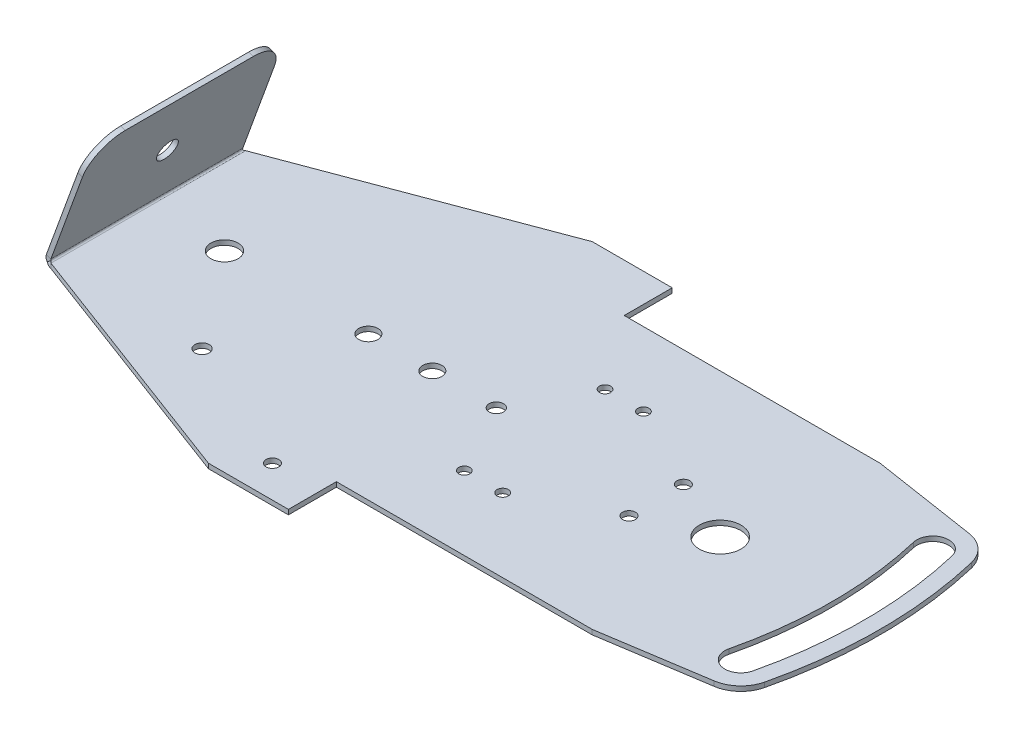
ISO-10303-21;
HEADER;
FILE_DESCRIPTION(('STEP AP214'),'2;1');
FILE_NAME('part.step','',(''),(''),'','','');
FILE_SCHEMA(('AUTOMOTIVE_DESIGN { 1 0 10303 214 1 1 1 1 }'));
ENDSEC;
DATA;
#1=APPLICATION_CONTEXT('core data for automotive mechanical design processes');
#2=APPLICATION_PROTOCOL_DEFINITION('international standard','automotive_design',2000,#1);
#3=PRODUCT_CONTEXT('',#1,'mechanical');
#4=PRODUCT('Part','Part','',(#3));
#5=PRODUCT_RELATED_PRODUCT_CATEGORY('part','',(#4));
#6=PRODUCT_DEFINITION_FORMATION('','',#4);
#7=PRODUCT_DEFINITION_CONTEXT('part definition',#1,'design');
#8=PRODUCT_DEFINITION('design','',#6,#7);
#9=PRODUCT_DEFINITION_SHAPE('','',#8);
#10=(LENGTH_UNIT() NAMED_UNIT(*) SI_UNIT(.MILLI.,.METRE.));
#11=(NAMED_UNIT(*) PLANE_ANGLE_UNIT() SI_UNIT($,.RADIAN.));
#12=(NAMED_UNIT(*) SI_UNIT($,.STERADIAN.) SOLID_ANGLE_UNIT());
#13=UNCERTAINTY_MEASURE_WITH_UNIT(LENGTH_MEASURE(1.E-05),#10,'distance_accuracy_value','');
#14=(GEOMETRIC_REPRESENTATION_CONTEXT(3) GLOBAL_UNCERTAINTY_ASSIGNED_CONTEXT((#13)) GLOBAL_UNIT_ASSIGNED_CONTEXT((#10,
#11,#12)) REPRESENTATION_CONTEXT('',''));
#15=CARTESIAN_POINT('',(0.,0.,0.));
#16=DIRECTION('',(0.,0.,1.));
#17=DIRECTION('',(1.,0.,0.));
#18=AXIS2_PLACEMENT_3D('',#15,#16,#17);
#19=CARTESIAN_POINT('',(49.1707382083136,28.2472687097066,-30.));
#20=DIRECTION('',(0.,0.,-1.));
#21=DIRECTION('',(0.342020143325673,0.939692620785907,0.));
#22=AXIS2_PLACEMENT_3D('',#19,#20,#21);
#23=PLANE('',#22);
#24=DIRECTION('',(0.342020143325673,0.939692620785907,0.));
#25=VECTOR('',#24,1.);
#26=CARTESIAN_POINT('',(50.5802771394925,27.7342384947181,-30.));
#27=LINE('',#26,#25);
#28=CARTESIAN_POINT('',(40.7300675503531,0.671010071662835,-30.));
#29=VERTEX_POINT('',#28);
#30=CARTESIAN_POINT('',(50.5802771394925,27.7342384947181,-30.));
#31=VERTEX_POINT('',#30);
#32=EDGE_CURVE('E79',#29,#31,#27,.T.);
#33=ORIENTED_EDGE('',*,*,#32,.F.);
#34=DIRECTION('',(-0.939692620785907,0.342020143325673,0.));
#35=VECTOR('',#34,1.);
#36=CARTESIAN_POINT('',(39.3205286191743,1.18404028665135,-30.));
#37=LINE('',#36,#35);
#38=CARTESIAN_POINT('',(39.3205286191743,1.18404028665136,-30.));
#39=VERTEX_POINT('',#38);
#40=EDGE_CURVE('E341',#29,#39,#37,.T.);
#41=ORIENTED_EDGE('',*,*,#40,.T.);
#42=DIRECTION('',(0.342020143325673,0.939692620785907,0.));
#43=VECTOR('',#42,1.);
#44=CARTESIAN_POINT('',(49.1707382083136,28.2472687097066,-30.));
#45=LINE('',#44,#43);
#46=CARTESIAN_POINT('',(49.1707382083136,28.2472687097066,-30.));
#47=VERTEX_POINT('',#46);
#48=EDGE_CURVE('E59',#39,#47,#45,.T.);
#49=ORIENTED_EDGE('',*,*,#48,.T.);
#50=DIRECTION('',(0.939692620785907,-0.342020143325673,0.));
#51=VECTOR('',#50,1.);
#52=CARTESIAN_POINT('',(49.1707382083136,28.2472687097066,-30.));
#53=LINE('',#52,#51);
#54=EDGE_CURVE('E350',#47,#31,#53,.T.);
#55=ORIENTED_EDGE('',*,*,#54,.T.);
#56=EDGE_LOOP('',(#33,#41,#49,#55));
#57=FACE_BOUND('',#56,.T.);
#58=ADVANCED_FACE('F55',(#57),#23,.T.);
#59=CARTESIAN_POINT('',(49.1707382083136,28.2472687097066,30.));
#60=DIRECTION('',(0.,0.,1.));
#61=DIRECTION('',(-0.342020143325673,-0.939692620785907,0.));
#62=AXIS2_PLACEMENT_3D('',#59,#60,#61);
#63=PLANE('',#62);
#64=DIRECTION('',(-0.342020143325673,-0.939692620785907,0.));
#65=VECTOR('',#64,1.);
#66=CARTESIAN_POINT('',(49.1707382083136,28.2472687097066,30.));
#67=LINE('',#66,#65);
#68=CARTESIAN_POINT('',(49.1707382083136,28.2472687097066,30.));
#69=VERTEX_POINT('',#68);
#70=CARTESIAN_POINT('',(39.3205286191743,1.18404028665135,30.));
#71=VERTEX_POINT('',#70);
#72=EDGE_CURVE('E347',#69,#71,#67,.T.);
#73=ORIENTED_EDGE('',*,*,#72,.T.);
#74=DIRECTION('',(0.939692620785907,-0.342020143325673,0.));
#75=VECTOR('',#74,1.);
#76=CARTESIAN_POINT('',(39.3205286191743,1.18404028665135,30.));
#77=LINE('',#76,#75);
#78=CARTESIAN_POINT('',(40.7300675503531,0.671010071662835,30.));
#79=VERTEX_POINT('',#78);
#80=EDGE_CURVE('E12',#71,#79,#77,.T.);
#81=ORIENTED_EDGE('',*,*,#80,.T.);
#82=DIRECTION('',(-0.342020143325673,-0.939692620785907,0.));
#83=VECTOR('',#82,1.);
#84=CARTESIAN_POINT('',(50.5802771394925,27.7342384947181,30.));
#85=LINE('',#84,#83);
#86=CARTESIAN_POINT('',(50.5802771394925,27.7342384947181,30.));
#87=VERTEX_POINT('',#86);
#88=EDGE_CURVE('E72',#87,#79,#85,.T.);
#89=ORIENTED_EDGE('',*,*,#88,.F.);
#90=DIRECTION('',(0.939692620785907,-0.342020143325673,0.));
#91=VECTOR('',#90,1.);
#92=CARTESIAN_POINT('',(49.1707382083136,28.2472687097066,30.));
#93=LINE('',#92,#91);
#94=EDGE_CURVE('E363',#69,#87,#93,.T.);
#95=ORIENTED_EDGE('',*,*,#94,.F.);
#96=EDGE_LOOP('',(#73,#81,#89,#95));
#97=FACE_BOUND('',#96,.T.);
#98=ADVANCED_FACE('F57',(#97),#63,.T.);
#99=CARTESIAN_POINT('',(-33.7246464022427,-203.891635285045,-30.0000000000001));
#100=DIRECTION('',(0.939692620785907,-0.342020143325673,0.));
#101=DIRECTION('',(0.,0.,1.));
#102=AXIS2_PLACEMENT_3D('',#99,#100,#101);
#103=PLANE('',#102);
#104=CARTESIAN_POINT('',(47.1600757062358,18.3373122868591,0.));
#105=DIRECTION('',(0.939692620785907,-0.342020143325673,0.));
#106=DIRECTION('',(0.,0.,1.));
#107=AXIS2_PLACEMENT_3D('',#104,#105,#106);
#108=CIRCLE('',#107,3.25);
#109=CARTESIAN_POINT('',(47.1600757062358,18.3373122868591,3.25));
#110=VERTEX_POINT('',#109);
#111=EDGE_CURVE('E437',#110,#110,#108,.T.);
#112=ORIENTED_EDGE('',*,*,#111,.F.);
#113=EDGE_LOOP('',(#112));
#114=FACE_BOUND('',#113,.T.);
#115=ORIENTED_EDGE('',*,*,#88,.T.);
#116=DIRECTION('',(0.,0.,-1.));
#117=VECTOR('',#116,1.);
#118=CARTESIAN_POINT('',(40.7300675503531,0.671010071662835,-30.0000000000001));
#119=LINE('',#118,#117);
#120=EDGE_CURVE('E64',#79,#29,#119,.T.);
#121=ORIENTED_EDGE('',*,*,#120,.T.);
#122=ORIENTED_EDGE('',*,*,#32,.T.);
#123=CARTESIAN_POINT('',(50.5802771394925,27.7342384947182,-20.));
#124=DIRECTION('',(0.939692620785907,-0.342020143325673,0.));
#125=DIRECTION('',(0.,0.,-1.));
#126=AXIS2_PLACEMENT_3D('',#123,#124,#125);
#127=CIRCLE('',#126,10.);
#128=CARTESIAN_POINT('',(54.0004785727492,37.1311647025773,-19.9999999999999));
#129=VERTEX_POINT('',#128);
#130=EDGE_CURVE('E352',#31,#129,#127,.T.);
#131=ORIENTED_EDGE('',*,*,#130,.T.);
#132=DIRECTION('',(0.,0.,1.));
#133=VECTOR('',#132,1.);
#134=CARTESIAN_POINT('',(54.0004785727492,37.1311647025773,19.9999999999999));
#135=LINE('',#134,#133);
#136=CARTESIAN_POINT('',(54.0004785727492,37.1311647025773,19.9999999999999));
#137=VERTEX_POINT('',#136);
#138=EDGE_CURVE('E356',#129,#137,#135,.T.);
#139=ORIENTED_EDGE('',*,*,#138,.T.);
#140=CARTESIAN_POINT('',(50.5802771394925,27.7342384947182,20.));
#141=DIRECTION('',(0.939692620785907,-0.342020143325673,0.));
#142=DIRECTION('',(0.,0.,1.));
#143=AXIS2_PLACEMENT_3D('',#140,#141,#142);
#144=CIRCLE('',#143,10.);
#145=EDGE_CURVE('E354',#137,#87,#144,.T.);
#146=ORIENTED_EDGE('',*,*,#145,.T.);
#147=EDGE_LOOP('',(#115,#121,#122,#131,#139,#146));
#148=FACE_BOUND('',#147,.T.);
#149=ADVANCED_FACE('F705',(#114,#148),#103,.T.);
#150=CARTESIAN_POINT('',(49.1707382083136,28.2472687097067,20.));
#151=DIRECTION('',(0.939692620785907,-0.342020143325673,0.));
#152=DIRECTION('',(0.,0.,1.));
#153=AXIS2_PLACEMENT_3D('',#150,#151,#152);
#154=CYLINDRICAL_SURFACE('',#153,10.);
#155=ORIENTED_EDGE('',*,*,#145,.F.);
#156=DIRECTION('',(0.939692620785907,-0.342020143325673,0.));
#157=VECTOR('',#156,1.);
#158=CARTESIAN_POINT('',(52.5909396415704,37.6441949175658,19.9999999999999));
#159=LINE('',#158,#157);
#160=CARTESIAN_POINT('',(52.5909396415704,37.6441949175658,19.9999999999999));
#161=VERTEX_POINT('',#160);
#162=EDGE_CURVE('E365',#161,#137,#159,.T.);
#163=ORIENTED_EDGE('',*,*,#162,.F.);
#164=CARTESIAN_POINT('',(49.1707382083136,28.2472687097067,20.));
#165=DIRECTION('',(0.939692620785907,-0.342020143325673,0.));
#166=DIRECTION('',(0.,0.,1.));
#167=AXIS2_PLACEMENT_3D('',#164,#165,#166);
#168=CIRCLE('',#167,10.);
#169=EDGE_CURVE('E351',#161,#69,#168,.T.);
#170=ORIENTED_EDGE('',*,*,#169,.T.);
#171=ORIENTED_EDGE('',*,*,#94,.T.);
#172=EDGE_LOOP('',(#155,#163,#170,#171));
#173=FACE_BOUND('',#172,.T.);
#174=ADVANCED_FACE('F716',(#173),#154,.T.);
#175=CARTESIAN_POINT('',(52.5909396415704,37.6441949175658,19.9999999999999));
#176=DIRECTION('',(0.342020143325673,0.939692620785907,0.));
#177=DIRECTION('',(0.,0.,1.));
#178=AXIS2_PLACEMENT_3D('',#175,#176,#177);
#179=PLANE('',#178);
#180=ORIENTED_EDGE('',*,*,#138,.F.);
#181=DIRECTION('',(0.939692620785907,-0.342020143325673,0.));
#182=VECTOR('',#181,1.);
#183=CARTESIAN_POINT('',(52.5909396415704,37.6441949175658,-19.9999999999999));
#184=LINE('',#183,#182);
#185=CARTESIAN_POINT('',(52.5909396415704,37.6441949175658,-19.9999999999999));
#186=VERTEX_POINT('',#185);
#187=EDGE_CURVE('E367',#186,#129,#184,.T.);
#188=ORIENTED_EDGE('',*,*,#187,.F.);
#189=DIRECTION('',(0.,0.,1.));
#190=VECTOR('',#189,1.);
#191=CARTESIAN_POINT('',(52.5909396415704,37.6441949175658,19.9999999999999));
#192=LINE('',#191,#190);
#193=EDGE_CURVE('E699',#186,#161,#192,.T.);
#194=ORIENTED_EDGE('',*,*,#193,.T.);
#195=ORIENTED_EDGE('',*,*,#162,.T.);
#196=EDGE_LOOP('',(#180,#188,#194,#195));
#197=FACE_BOUND('',#196,.T.);
#198=ADVANCED_FACE('F713',(#197),#179,.T.);
#199=CARTESIAN_POINT('',(49.1707382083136,28.2472687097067,-20.));
#200=DIRECTION('',(0.939692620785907,-0.342020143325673,0.));
#201=DIRECTION('',(0.,0.,1.));
#202=AXIS2_PLACEMENT_3D('',#199,#200,#201);
#203=CYLINDRICAL_SURFACE('',#202,10.);
#204=ORIENTED_EDGE('',*,*,#130,.F.);
#205=ORIENTED_EDGE('',*,*,#54,.F.);
#206=CARTESIAN_POINT('',(49.1707382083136,28.2472687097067,-20.));
#207=DIRECTION('',(0.939692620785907,-0.342020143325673,0.));
#208=DIRECTION('',(0.,0.,-1.));
#209=AXIS2_PLACEMENT_3D('',#206,#207,#208);
#210=CIRCLE('',#209,10.);
#211=EDGE_CURVE('E355',#47,#186,#210,.T.);
#212=ORIENTED_EDGE('',*,*,#211,.T.);
#213=ORIENTED_EDGE('',*,*,#187,.T.);
#214=EDGE_LOOP('',(#204,#205,#212,#213));
#215=FACE_BOUND('',#214,.T.);
#216=ADVANCED_FACE('F709',(#215),#203,.T.);
#217=CARTESIAN_POINT('',(-35.1341853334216,-203.378605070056,-30.0000000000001));
#218=DIRECTION('',(0.939692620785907,-0.342020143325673,0.));
#219=DIRECTION('',(0.,0.,1.));
#220=AXIS2_PLACEMENT_3D('',#217,#218,#219);
#221=PLANE('',#220);
#222=DIRECTION('',(0.,0.,-1.));
#223=VECTOR('',#222,1.);
#224=CARTESIAN_POINT('',(39.3205286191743,1.18404028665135,-30.0000000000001));
#225=LINE('',#224,#223);
#226=EDGE_CURVE('E343',#71,#39,#225,.T.);
#227=ORIENTED_EDGE('',*,*,#226,.F.);
#228=ORIENTED_EDGE('',*,*,#72,.F.);
#229=ORIENTED_EDGE('',*,*,#169,.F.);
#230=ORIENTED_EDGE('',*,*,#193,.F.);
#231=ORIENTED_EDGE('',*,*,#211,.F.);
#232=ORIENTED_EDGE('',*,*,#48,.F.);
#233=EDGE_LOOP('',(#227,#228,#229,#230,#231,#232));
#234=FACE_BOUND('',#233,.T.);
#235=CARTESIAN_POINT('',(45.7505367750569,18.8503425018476,0.));
#236=DIRECTION('',(0.939692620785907,-0.342020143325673,0.));
#237=DIRECTION('',(0.,0.,1.));
#238=AXIS2_PLACEMENT_3D('',#235,#236,#237);
#239=CIRCLE('',#238,3.25);
#240=CARTESIAN_POINT('',(45.7505367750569,18.8503425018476,3.25));
#241=VERTEX_POINT('',#240);
#242=EDGE_CURVE('E353',#241,#241,#239,.T.);
#243=ORIENTED_EDGE('',*,*,#242,.T.);
#244=EDGE_LOOP('',(#243));
#245=FACE_BOUND('',#244,.T.);
#246=ADVANCED_FACE('F718',(#234,#245),#221,.F.);
#247=CARTESIAN_POINT('',(45.7505367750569,18.8503425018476,0.));
#248=DIRECTION('',(0.939692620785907,-0.342020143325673,0.));
#249=DIRECTION('',(0.,0.,1.));
#250=AXIS2_PLACEMENT_3D('',#247,#248,#249);
#251=CYLINDRICAL_SURFACE('',#250,3.25);
#252=ORIENTED_EDGE('',*,*,#242,.F.);
#253=EDGE_LOOP('',(#252));
#254=FACE_BOUND('',#253,.T.);
#255=ORIENTED_EDGE('',*,*,#111,.T.);
#256=EDGE_LOOP('',(#255));
#257=FACE_BOUND('',#256,.T.);
#258=ADVANCED_FACE('F677',(#254,#257),#251,.F.);
#259=CARTESIAN_POINT('',(120.,-1.5,60.));
#260=DIRECTION('',(0.,0.,1.));
#261=DIRECTION('',(1.,0.,0.));
#262=AXIS2_PLACEMENT_3D('',#259,#260,#261);
#263=PLANE('',#262);
#264=DIRECTION('',(1.,0.,0.));
#265=VECTOR('',#264,1.);
#266=CARTESIAN_POINT('',(120.,0.,60.));
#267=LINE('',#266,#265);
#268=CARTESIAN_POINT('',(120.,0.,60.));
#269=VERTEX_POINT('',#268);
#270=CARTESIAN_POINT('',(145.,0.,60.));
#271=VERTEX_POINT('',#270);
#272=EDGE_CURVE('E470',#269,#271,#267,.T.);
#273=ORIENTED_EDGE('',*,*,#272,.F.);
#274=DIRECTION('',(0.,1.,0.));
#275=VECTOR('',#274,1.);
#276=CARTESIAN_POINT('',(120.,-1.5,60.));
#277=LINE('',#276,#275);
#278=CARTESIAN_POINT('',(120.,-1.5,60.));
#279=VERTEX_POINT('',#278);
#280=EDGE_CURVE('E429',#279,#269,#277,.T.);
#281=ORIENTED_EDGE('',*,*,#280,.F.);
#282=DIRECTION('',(1.,0.,0.));
#283=VECTOR('',#282,1.);
#284=CARTESIAN_POINT('',(120.,-1.5,60.));
#285=LINE('',#284,#283);
#286=CARTESIAN_POINT('',(145.,-1.5,60.));
#287=VERTEX_POINT('',#286);
#288=EDGE_CURVE('E636',#279,#287,#285,.T.);
#289=ORIENTED_EDGE('',*,*,#288,.T.);
#290=DIRECTION('',(0.,1.,0.));
#291=VECTOR('',#290,1.);
#292=CARTESIAN_POINT('',(145.,-1.5,60.));
#293=LINE('',#292,#291);
#294=EDGE_CURVE('E634',#287,#271,#293,.T.);
#295=ORIENTED_EDGE('',*,*,#294,.T.);
#296=EDGE_LOOP('',(#273,#281,#289,#295));
#297=FACE_BOUND('',#296,.T.);
#298=ADVANCED_FACE('F735',(#297),#263,.T.);
#299=CARTESIAN_POINT('',(145.,-1.5,60.));
#300=DIRECTION('',(1.,0.,0.));
#301=DIRECTION('',(0.,0.,-1.));
#302=AXIS2_PLACEMENT_3D('',#299,#300,#301);
#303=PLANE('',#302);
#304=DIRECTION('',(0.,0.,-1.));
#305=VECTOR('',#304,1.);
#306=CARTESIAN_POINT('',(145.,0.,60.));
#307=LINE('',#306,#305);
#308=CARTESIAN_POINT('',(145.,0.,45.));
#309=VERTEX_POINT('',#308);
#310=EDGE_CURVE('E467',#271,#309,#307,.T.);
#311=ORIENTED_EDGE('',*,*,#310,.F.);
#312=ORIENTED_EDGE('',*,*,#294,.F.);
#313=DIRECTION('',(0.,0.,-1.));
#314=VECTOR('',#313,1.);
#315=CARTESIAN_POINT('',(145.,-1.5,60.));
#316=LINE('',#315,#314);
#317=CARTESIAN_POINT('',(145.,-1.5,45.));
#318=VERTEX_POINT('',#317);
#319=EDGE_CURVE('E631',#287,#318,#316,.T.);
#320=ORIENTED_EDGE('',*,*,#319,.T.);
#321=DIRECTION('',(0.,1.,0.));
#322=VECTOR('',#321,1.);
#323=CARTESIAN_POINT('',(145.,-1.5,45.));
#324=LINE('',#323,#322);
#325=EDGE_CURVE('E629',#318,#309,#324,.T.);
#326=ORIENTED_EDGE('',*,*,#325,.T.);
#327=EDGE_LOOP('',(#311,#312,#320,#326));
#328=FACE_BOUND('',#327,.T.);
#329=ADVANCED_FACE('F741',(#328),#303,.T.);
#330=CARTESIAN_POINT('',(145.,-1.5,45.));
#331=DIRECTION('',(0.,0.,1.));
#332=DIRECTION('',(1.,0.,0.));
#333=AXIS2_PLACEMENT_3D('',#330,#331,#332);
#334=PLANE('',#333);
#335=DIRECTION('',(1.,0.,0.));
#336=VECTOR('',#335,1.);
#337=CARTESIAN_POINT('',(145.,0.,45.));
#338=LINE('',#337,#336);
#339=CARTESIAN_POINT('',(225.,0.,45.));
#340=VERTEX_POINT('',#339);
#341=EDGE_CURVE('E464',#309,#340,#338,.T.);
#342=ORIENTED_EDGE('',*,*,#341,.F.);
#343=ORIENTED_EDGE('',*,*,#325,.F.);
#344=DIRECTION('',(1.,0.,0.));
#345=VECTOR('',#344,1.);
#346=CARTESIAN_POINT('',(145.,-1.5,45.));
#347=LINE('',#346,#345);
#348=CARTESIAN_POINT('',(225.,-1.5,45.));
#349=VERTEX_POINT('',#348);
#350=EDGE_CURVE('E626',#318,#349,#347,.T.);
#351=ORIENTED_EDGE('',*,*,#350,.T.);
#352=DIRECTION('',(0.,1.,0.));
#353=VECTOR('',#352,1.);
#354=CARTESIAN_POINT('',(225.,-1.5,45.));
#355=LINE('',#354,#353);
#356=EDGE_CURVE('E624',#349,#340,#355,.T.);
#357=ORIENTED_EDGE('',*,*,#356,.T.);
#358=EDGE_LOOP('',(#342,#343,#351,#357));
#359=FACE_BOUND('',#358,.T.);
#360=ADVANCED_FACE('F792',(#359),#334,.T.);
#361=CARTESIAN_POINT('',(225.,-1.5,45.));
#362=DIRECTION('',(0.153155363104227,0.,0.988202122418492));
#363=DIRECTION('',(0.988202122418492,0.,-0.153155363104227));
#364=AXIS2_PLACEMENT_3D('',#361,#362,#363);
#365=PLANE('',#364);
#366=DIRECTION('',(0.988202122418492,0.,-0.153155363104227));
#367=VECTOR('',#366,1.);
#368=CARTESIAN_POINT('',(225.,0.,45.));
#369=LINE('',#368,#367);
#370=CARTESIAN_POINT('',(258.022660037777,0.,39.8820212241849));
#371=VERTEX_POINT('',#370);
#372=EDGE_CURVE('E461',#340,#371,#369,.T.);
#373=ORIENTED_EDGE('',*,*,#372,.F.);
#374=ORIENTED_EDGE('',*,*,#356,.F.);
#375=DIRECTION('',(0.988202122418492,0.,-0.153155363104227));
#376=VECTOR('',#375,1.);
#377=CARTESIAN_POINT('',(225.,-1.5,45.));
#378=LINE('',#377,#376);
#379=CARTESIAN_POINT('',(258.022660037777,-1.5,39.8820212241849));
#380=VERTEX_POINT('',#379);
#381=EDGE_CURVE('E621',#349,#380,#378,.T.);
#382=ORIENTED_EDGE('',*,*,#381,.T.);
#383=DIRECTION('',(0.,1.,0.));
#384=VECTOR('',#383,1.);
#385=CARTESIAN_POINT('',(258.022660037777,-1.5,39.8820212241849));
#386=LINE('',#385,#384);
#387=EDGE_CURVE('E619',#380,#371,#386,.T.);
#388=ORIENTED_EDGE('',*,*,#387,.T.);
#389=EDGE_LOOP('',(#373,#374,#382,#388));
#390=FACE_BOUND('',#389,.T.);
#391=ADVANCED_FACE('F802',(#390),#365,.T.);
#392=CARTESIAN_POINT('',(256.491106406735,-1.5,30.));
#393=DIRECTION('',(0.,1.,0.));
#394=DIRECTION('',(0.,0.,1.));
#395=AXIS2_PLACEMENT_3D('',#392,#393,#394);
#396=CYLINDRICAL_SURFACE('',#395,10.);
#397=CARTESIAN_POINT('',(256.491106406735,0.,30.));
#398=DIRECTION('',(0.,1.,0.));
#399=DIRECTION('',(0.,0.,-1.));
#400=AXIS2_PLACEMENT_3D('',#397,#398,#399);
#401=CIRCLE('',#400,10.);
#402=CARTESIAN_POINT('',(266.221191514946,0.,32.3076923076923));
#403=VERTEX_POINT('',#402);
#404=EDGE_CURVE('E458',#371,#403,#401,.T.);
#405=ORIENTED_EDGE('',*,*,#404,.F.);
#406=ORIENTED_EDGE('',*,*,#387,.F.);
#407=CARTESIAN_POINT('',(256.491106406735,-1.5,30.));
#408=DIRECTION('',(0.,1.,0.));
#409=DIRECTION('',(0.,0.,-1.));
#410=AXIS2_PLACEMENT_3D('',#407,#408,#409);
#411=CIRCLE('',#410,10.);
#412=CARTESIAN_POINT('',(266.221191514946,-1.5,32.3076923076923));
#413=VERTEX_POINT('',#412);
#414=EDGE_CURVE('E616',#380,#413,#411,.T.);
#415=ORIENTED_EDGE('',*,*,#414,.T.);
#416=DIRECTION('',(0.,1.,0.));
#417=VECTOR('',#416,1.);
#418=CARTESIAN_POINT('',(266.221191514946,-1.5,32.3076923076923));
#419=LINE('',#418,#417);
#420=EDGE_CURVE('E614',#413,#403,#419,.T.);
#421=ORIENTED_EDGE('',*,*,#420,.T.);
#422=EDGE_LOOP('',(#405,#406,#415,#421));
#423=FACE_BOUND('',#422,.T.);
#424=ADVANCED_FACE('F812',(#423),#396,.T.);
#425=CARTESIAN_POINT('',(130.,-1.5,0.));
#426=DIRECTION('',(0.,1.,0.));
#427=DIRECTION('',(0.,0.,1.));
#428=AXIS2_PLACEMENT_3D('',#425,#426,#427);
#429=CYLINDRICAL_SURFACE('',#428,140.);
#430=CARTESIAN_POINT('',(130.,0.,0.));
#431=DIRECTION('',(0.,1.,0.));
#432=DIRECTION('',(0.,0.,1.));
#433=AXIS2_PLACEMENT_3D('',#430,#431,#432);
#434=CIRCLE('',#433,140.);
#435=CARTESIAN_POINT('',(266.221191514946,0.,-32.3076923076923));
#436=VERTEX_POINT('',#435);
#437=EDGE_CURVE('E455',#403,#436,#434,.T.);
#438=ORIENTED_EDGE('',*,*,#437,.F.);
#439=ORIENTED_EDGE('',*,*,#420,.F.);
#440=CARTESIAN_POINT('',(130.,-1.5,0.));
#441=DIRECTION('',(0.,1.,0.));
#442=DIRECTION('',(0.,0.,1.));
#443=AXIS2_PLACEMENT_3D('',#440,#441,#442);
#444=CIRCLE('',#443,140.);
#445=CARTESIAN_POINT('',(266.221191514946,-1.5,-32.3076923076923));
#446=VERTEX_POINT('',#445);
#447=EDGE_CURVE('E611',#413,#446,#444,.T.);
#448=ORIENTED_EDGE('',*,*,#447,.T.);
#449=DIRECTION('',(0.,1.,0.));
#450=VECTOR('',#449,1.);
#451=CARTESIAN_POINT('',(266.221191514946,-1.5,-32.3076923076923));
#452=LINE('',#451,#450);
#453=EDGE_CURVE('E609',#446,#436,#452,.T.);
#454=ORIENTED_EDGE('',*,*,#453,.T.);
#455=EDGE_LOOP('',(#438,#439,#448,#454));
#456=FACE_BOUND('',#455,.T.);
#457=ADVANCED_FACE('F822',(#456),#429,.T.);
#458=CARTESIAN_POINT('',(256.491106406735,-1.5,-30.0000000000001));
#459=DIRECTION('',(0.,1.,0.));
#460=DIRECTION('',(0.,0.,1.));
#461=AXIS2_PLACEMENT_3D('',#458,#459,#460);
#462=CYLINDRICAL_SURFACE('',#461,9.99999999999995);
#463=CARTESIAN_POINT('',(256.491106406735,0.,-30.0000000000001));
#464=DIRECTION('',(0.,1.,0.));
#465=DIRECTION('',(0.,0.,1.));
#466=AXIS2_PLACEMENT_3D('',#463,#464,#465);
#467=CIRCLE('',#466,9.99999999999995);
#468=CARTESIAN_POINT('',(258.022660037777,0.,-39.8820212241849));
#469=VERTEX_POINT('',#468);
#470=EDGE_CURVE('E452',#436,#469,#467,.T.);
#471=ORIENTED_EDGE('',*,*,#470,.F.);
#472=ORIENTED_EDGE('',*,*,#453,.F.);
#473=CARTESIAN_POINT('',(256.491106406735,-1.5,-30.0000000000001));
#474=DIRECTION('',(0.,1.,0.));
#475=DIRECTION('',(0.,0.,1.));
#476=AXIS2_PLACEMENT_3D('',#473,#474,#475);
#477=CIRCLE('',#476,9.99999999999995);
#478=CARTESIAN_POINT('',(258.022660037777,-1.5,-39.8820212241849));
#479=VERTEX_POINT('',#478);
#480=EDGE_CURVE('E606',#446,#479,#477,.T.);
#481=ORIENTED_EDGE('',*,*,#480,.T.);
#482=DIRECTION('',(0.,1.,0.));
#483=VECTOR('',#482,1.);
#484=CARTESIAN_POINT('',(258.022660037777,-1.5,-39.8820212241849));
#485=LINE('',#484,#483);
#486=EDGE_CURVE('E604',#479,#469,#485,.T.);
#487=ORIENTED_EDGE('',*,*,#486,.T.);
#488=EDGE_LOOP('',(#471,#472,#481,#487));
#489=FACE_BOUND('',#488,.T.);
#490=ADVANCED_FACE('F832',(#489),#462,.T.);
#491=CARTESIAN_POINT('',(225.,-1.5,-45.));
#492=DIRECTION('',(0.153155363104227,0.,-0.988202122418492));
#493=DIRECTION('',(-0.988202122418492,0.,-0.153155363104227));
#494=AXIS2_PLACEMENT_3D('',#491,#492,#493);
#495=PLANE('',#494);
#496=DIRECTION('',(-0.988202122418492,0.,-0.153155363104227));
#497=VECTOR('',#496,1.);
#498=CARTESIAN_POINT('',(225.,0.,-45.));
#499=LINE('',#498,#497);
#500=CARTESIAN_POINT('',(225.,0.,-45.));
#501=VERTEX_POINT('',#500);
#502=EDGE_CURVE('E449',#469,#501,#499,.T.);
#503=ORIENTED_EDGE('',*,*,#502,.F.);
#504=ORIENTED_EDGE('',*,*,#486,.F.);
#505=DIRECTION('',(-0.988202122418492,0.,-0.153155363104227));
#506=VECTOR('',#505,1.);
#507=CARTESIAN_POINT('',(225.,-1.5,-45.));
#508=LINE('',#507,#506);
#509=CARTESIAN_POINT('',(225.,-1.5,-45.));
#510=VERTEX_POINT('',#509);
#511=EDGE_CURVE('E601',#479,#510,#508,.T.);
#512=ORIENTED_EDGE('',*,*,#511,.T.);
#513=DIRECTION('',(0.,1.,0.));
#514=VECTOR('',#513,1.);
#515=CARTESIAN_POINT('',(225.,-1.5,-45.));
#516=LINE('',#515,#514);
#517=EDGE_CURVE('E599',#510,#501,#516,.T.);
#518=ORIENTED_EDGE('',*,*,#517,.T.);
#519=EDGE_LOOP('',(#503,#504,#512,#518));
#520=FACE_BOUND('',#519,.T.);
#521=ADVANCED_FACE('F842',(#520),#495,.T.);
#522=CARTESIAN_POINT('',(145.,-1.5,-45.));
#523=DIRECTION('',(0.,0.,-1.));
#524=DIRECTION('',(-1.,0.,0.));
#525=AXIS2_PLACEMENT_3D('',#522,#523,#524);
#526=PLANE('',#525);
#527=DIRECTION('',(-1.,0.,0.));
#528=VECTOR('',#527,1.);
#529=CARTESIAN_POINT('',(145.,0.,-45.));
#530=LINE('',#529,#528);
#531=CARTESIAN_POINT('',(145.,0.,-45.));
#532=VERTEX_POINT('',#531);
#533=EDGE_CURVE('E446',#501,#532,#530,.T.);
#534=ORIENTED_EDGE('',*,*,#533,.F.);
#535=ORIENTED_EDGE('',*,*,#517,.F.);
#536=DIRECTION('',(-1.,0.,0.));
#537=VECTOR('',#536,1.);
#538=CARTESIAN_POINT('',(145.,-1.5,-45.));
#539=LINE('',#538,#537);
#540=CARTESIAN_POINT('',(145.,-1.5,-45.));
#541=VERTEX_POINT('',#540);
#542=EDGE_CURVE('E596',#510,#541,#539,.T.);
#543=ORIENTED_EDGE('',*,*,#542,.T.);
#544=DIRECTION('',(0.,1.,0.));
#545=VECTOR('',#544,1.);
#546=CARTESIAN_POINT('',(145.,-1.5,-45.));
#547=LINE('',#546,#545);
#548=EDGE_CURVE('E594',#541,#532,#547,.T.);
#549=ORIENTED_EDGE('',*,*,#548,.T.);
#550=EDGE_LOOP('',(#534,#535,#543,#549));
#551=FACE_BOUND('',#550,.T.);
#552=ADVANCED_FACE('F852',(#551),#526,.T.);
#553=CARTESIAN_POINT('',(145.,-1.5,-60.));
#554=DIRECTION('',(1.,0.,0.));
#555=DIRECTION('',(0.,0.,-1.));
#556=AXIS2_PLACEMENT_3D('',#553,#554,#555);
#557=PLANE('',#556);
#558=DIRECTION('',(0.,0.,-1.));
#559=VECTOR('',#558,1.);
#560=CARTESIAN_POINT('',(145.,0.,-60.));
#561=LINE('',#560,#559);
#562=CARTESIAN_POINT('',(145.,0.,-60.));
#563=VERTEX_POINT('',#562);
#564=EDGE_CURVE('E443',#532,#563,#561,.T.);
#565=ORIENTED_EDGE('',*,*,#564,.F.);
#566=ORIENTED_EDGE('',*,*,#548,.F.);
#567=DIRECTION('',(0.,0.,-1.));
#568=VECTOR('',#567,1.);
#569=CARTESIAN_POINT('',(145.,-1.5,-60.));
#570=LINE('',#569,#568);
#571=CARTESIAN_POINT('',(145.,-1.5,-60.));
#572=VERTEX_POINT('',#571);
#573=EDGE_CURVE('E591',#541,#572,#570,.T.);
#574=ORIENTED_EDGE('',*,*,#573,.T.);
#575=DIRECTION('',(0.,1.,0.));
#576=VECTOR('',#575,1.);
#577=CARTESIAN_POINT('',(145.,-1.5,-60.));
#578=LINE('',#577,#576);
#579=EDGE_CURVE('E589',#572,#563,#578,.T.);
#580=ORIENTED_EDGE('',*,*,#579,.T.);
#581=EDGE_LOOP('',(#565,#566,#574,#580));
#582=FACE_BOUND('',#581,.T.);
#583=ADVANCED_FACE('F862',(#582),#557,.T.);
#584=CARTESIAN_POINT('',(120.,-1.5,-60.));
#585=DIRECTION('',(0.,0.,-1.));
#586=DIRECTION('',(-1.,0.,0.));
#587=AXIS2_PLACEMENT_3D('',#584,#585,#586);
#588=PLANE('',#587);
#589=DIRECTION('',(-1.,0.,0.));
#590=VECTOR('',#589,1.);
#591=CARTESIAN_POINT('',(120.,0.,-60.));
#592=LINE('',#591,#590);
#593=CARTESIAN_POINT('',(120.,0.,-60.));
#594=VERTEX_POINT('',#593);
#595=EDGE_CURVE('E439',#563,#594,#592,.T.);
#596=ORIENTED_EDGE('',*,*,#595,.F.);
#597=ORIENTED_EDGE('',*,*,#579,.F.);
#598=DIRECTION('',(-1.,0.,0.));
#599=VECTOR('',#598,1.);
#600=CARTESIAN_POINT('',(120.,-1.5,-60.));
#601=LINE('',#600,#599);
#602=CARTESIAN_POINT('',(120.,-1.5,-60.));
#603=VERTEX_POINT('',#602);
#604=EDGE_CURVE('E586',#572,#603,#601,.T.);
#605=ORIENTED_EDGE('',*,*,#604,.T.);
#606=DIRECTION('',(0.,1.,0.));
#607=VECTOR('',#606,1.);
#608=CARTESIAN_POINT('',(120.,-1.5,-60.));
#609=LINE('',#608,#607);
#610=EDGE_CURVE('E584',#603,#594,#609,.T.);
#611=ORIENTED_EDGE('',*,*,#610,.T.);
#612=EDGE_LOOP('',(#596,#597,#605,#611));
#613=FACE_BOUND('',#612,.T.);
#614=ADVANCED_FACE('F872',(#613),#588,.T.);
#615=CARTESIAN_POINT('',(256.491106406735,-1.5,-30.0000000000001));
#616=DIRECTION('',(0.,1.,0.));
#617=DIRECTION('',(0.,0.,1.));
#618=AXIS2_PLACEMENT_3D('',#615,#616,#617);
#619=CYLINDRICAL_SURFACE('',#618,4.99999999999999);
#620=CARTESIAN_POINT('',(256.491106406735,0.,-30.0000000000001));
#621=DIRECTION('',(0.,1.,0.));
#622=DIRECTION('',(0.,0.,1.));
#623=AXIS2_PLACEMENT_3D('',#620,#621,#622);
#624=CIRCLE('',#623,4.99999999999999);
#625=CARTESIAN_POINT('',(261.35614896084,0.,-31.1538461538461));
#626=VERTEX_POINT('',#625);
#627=CARTESIAN_POINT('',(251.62606385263,0.,-28.8461538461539));
#628=VERTEX_POINT('',#627);
#629=EDGE_CURVE('E581',#626,#628,#624,.T.);
#630=ORIENTED_EDGE('',*,*,#629,.T.);
#631=DIRECTION('',(0.,1.,0.));
#632=VECTOR('',#631,1.);
#633=CARTESIAN_POINT('',(251.62606385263,-1.5,-28.8461538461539));
#634=LINE('',#633,#632);
#635=CARTESIAN_POINT('',(251.62606385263,-1.5,-28.8461538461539));
#636=VERTEX_POINT('',#635);
#637=EDGE_CURVE('E564',#636,#628,#634,.T.);
#638=ORIENTED_EDGE('',*,*,#637,.F.);
#639=CARTESIAN_POINT('',(256.491106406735,-1.5,-30.0000000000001));
#640=DIRECTION('',(0.,1.,0.));
#641=DIRECTION('',(0.,0.,1.));
#642=AXIS2_PLACEMENT_3D('',#639,#640,#641);
#643=CIRCLE('',#642,4.99999999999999);
#644=CARTESIAN_POINT('',(261.35614896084,-1.5,-31.1538461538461));
#645=VERTEX_POINT('',#644);
#646=EDGE_CURVE('E474',#645,#636,#643,.T.);
#647=ORIENTED_EDGE('',*,*,#646,.F.);
#648=DIRECTION('',(0.,1.,0.));
#649=VECTOR('',#648,1.);
#650=CARTESIAN_POINT('',(261.35614896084,-1.5,-31.1538461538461));
#651=LINE('',#650,#649);
#652=EDGE_CURVE('E579',#645,#626,#651,.T.);
#653=ORIENTED_EDGE('',*,*,#652,.T.);
#654=EDGE_LOOP('',(#630,#638,#647,#653));
#655=FACE_BOUND('',#654,.T.);
#656=ADVANCED_FACE('F882',(#655),#619,.F.);
#657=CARTESIAN_POINT('',(130.,-1.5,0.));
#658=DIRECTION('',(0.,1.,0.));
#659=DIRECTION('',(0.,0.,1.));
#660=AXIS2_PLACEMENT_3D('',#657,#658,#659);
#661=CYLINDRICAL_SURFACE('',#660,135.);
#662=CARTESIAN_POINT('',(130.,0.,0.));
#663=DIRECTION('',(0.,1.,0.));
#664=DIRECTION('',(0.,0.,1.));
#665=AXIS2_PLACEMENT_3D('',#662,#663,#664);
#666=CIRCLE('',#665,135.);
#667=CARTESIAN_POINT('',(261.353138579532,0.,31.1665363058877));
#668=VERTEX_POINT('',#667);
#669=EDGE_CURVE('E576',#668,#626,#666,.T.);
#670=ORIENTED_EDGE('',*,*,#669,.T.);
#671=ORIENTED_EDGE('',*,*,#652,.F.);
#672=CARTESIAN_POINT('',(130.,-1.5,0.));
#673=DIRECTION('',(0.,1.,0.));
#674=DIRECTION('',(0.,0.,1.));
#675=AXIS2_PLACEMENT_3D('',#672,#673,#674);
#676=CIRCLE('',#675,135.);
#677=CARTESIAN_POINT('',(261.353138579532,-1.5,31.1665363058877));
#678=VERTEX_POINT('',#677);
#679=EDGE_CURVE('E477',#678,#645,#676,.T.);
#680=ORIENTED_EDGE('',*,*,#679,.F.);
#681=DIRECTION('',(0.,1.,0.));
#682=VECTOR('',#681,1.);
#683=CARTESIAN_POINT('',(261.353138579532,-1.5,31.1665363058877));
#684=LINE('',#683,#682);
#685=EDGE_CURVE('E573',#678,#668,#684,.T.);
#686=ORIENTED_EDGE('',*,*,#685,.T.);
#687=EDGE_LOOP('',(#670,#671,#680,#686));
#688=FACE_BOUND('',#687,.T.);
#689=ADVANCED_FACE('F892',(#688),#661,.F.);
#690=CARTESIAN_POINT('',(256.488207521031,-1.5,30.0122201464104));
#691=DIRECTION('',(0.,1.,0.));
#692=DIRECTION('',(0.,0.,1.));
#693=AXIS2_PLACEMENT_3D('',#690,#691,#692);
#694=CYLINDRICAL_SURFACE('',#693,5.);
#695=CARTESIAN_POINT('',(256.488207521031,0.,30.0122201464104));
#696=DIRECTION('',(0.,1.,0.));
#697=DIRECTION('',(0.,0.,1.));
#698=AXIS2_PLACEMENT_3D('',#695,#696,#697);
#699=CIRCLE('',#698,5.);
#700=CARTESIAN_POINT('',(251.62327646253,0.,28.857903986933));
#701=VERTEX_POINT('',#700);
#702=EDGE_CURVE('E571',#701,#668,#699,.T.);
#703=ORIENTED_EDGE('',*,*,#702,.T.);
#704=ORIENTED_EDGE('',*,*,#685,.F.);
#705=CARTESIAN_POINT('',(256.488207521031,-1.5,30.0122201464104));
#706=DIRECTION('',(0.,1.,0.));
#707=DIRECTION('',(0.,0.,1.));
#708=AXIS2_PLACEMENT_3D('',#705,#706,#707);
#709=CIRCLE('',#708,5.);
#710=CARTESIAN_POINT('',(251.62327646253,-1.5,28.857903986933));
#711=VERTEX_POINT('',#710);
#712=EDGE_CURVE('E480',#711,#678,#709,.T.);
#713=ORIENTED_EDGE('',*,*,#712,.F.);
#714=DIRECTION('',(0.,1.,0.));
#715=VECTOR('',#714,1.);
#716=CARTESIAN_POINT('',(251.62327646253,-1.5,28.857903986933));
#717=LINE('',#716,#715);
#718=EDGE_CURVE('E569',#711,#701,#717,.T.);
#719=ORIENTED_EDGE('',*,*,#718,.T.);
#720=EDGE_LOOP('',(#703,#704,#713,#719));
#721=FACE_BOUND('',#720,.T.);
#722=ADVANCED_FACE('F902',(#721),#694,.F.);
#723=CARTESIAN_POINT('',(130.,-1.5,0.));
#724=DIRECTION('',(0.,1.,0.));
#725=DIRECTION('',(0.,0.,1.));
#726=AXIS2_PLACEMENT_3D('',#723,#724,#725);
#727=CYLINDRICAL_SURFACE('',#726,125.);
#728=CARTESIAN_POINT('',(130.,0.,0.));
#729=DIRECTION('',(0.,-1.,0.));
#730=DIRECTION('',(0.,0.,1.));
#731=AXIS2_PLACEMENT_3D('',#728,#729,#730);
#732=CIRCLE('',#731,125.);
#733=EDGE_CURVE('E566',#628,#701,#732,.T.);
#734=ORIENTED_EDGE('',*,*,#733,.T.);
#735=ORIENTED_EDGE('',*,*,#718,.F.);
#736=CARTESIAN_POINT('',(130.,-1.5,0.));
#737=DIRECTION('',(0.,-1.,0.));
#738=DIRECTION('',(0.,0.,1.));
#739=AXIS2_PLACEMENT_3D('',#736,#737,#738);
#740=CIRCLE('',#739,125.);
#741=EDGE_CURVE('E483',#636,#711,#740,.T.);
#742=ORIENTED_EDGE('',*,*,#741,.F.);
#743=ORIENTED_EDGE('',*,*,#637,.T.);
#744=EDGE_LOOP('',(#734,#735,#742,#743));
#745=FACE_BOUND('',#744,.T.);
#746=ADVANCED_FACE('F912',(#745),#727,.T.);
#747=CARTESIAN_POINT('',(130.,-1.5,50.));
#748=DIRECTION('',(0.,1.,0.));
#749=DIRECTION('',(0.,0.,1.));
#750=AXIS2_PLACEMENT_3D('',#747,#748,#749);
#751=CYLINDRICAL_SURFACE('',#750,2.);
#752=CARTESIAN_POINT('',(130.,-1.5,50.));
#753=DIRECTION('',(0.,1.,0.));
#754=DIRECTION('',(0.,0.,1.));
#755=AXIS2_PLACEMENT_3D('',#752,#753,#754);
#756=CIRCLE('',#755,2.);
#757=CARTESIAN_POINT('',(130.,-1.5,52.));
#758=VERTEX_POINT('',#757);
#759=EDGE_CURVE('E486',#758,#758,#756,.T.);
#760=ORIENTED_EDGE('',*,*,#759,.F.);
#761=EDGE_LOOP('',(#760));
#762=FACE_BOUND('',#761,.T.);
#763=CARTESIAN_POINT('',(130.,0.,50.));
#764=DIRECTION('',(0.,1.,0.));
#765=DIRECTION('',(0.,0.,1.));
#766=AXIS2_PLACEMENT_3D('',#763,#764,#765);
#767=CIRCLE('',#766,2.);
#768=CARTESIAN_POINT('',(130.,0.,52.));
#769=VERTEX_POINT('',#768);
#770=EDGE_CURVE('E561',#769,#769,#767,.T.);
#771=ORIENTED_EDGE('',*,*,#770,.T.);
#772=EDGE_LOOP('',(#771));
#773=FACE_BOUND('',#772,.T.);
#774=ADVANCED_FACE('F922',(#762,#773),#751,.F.);
#775=CARTESIAN_POINT('',(88.,-1.5,30.));
#776=DIRECTION('',(0.,1.,0.));
#777=DIRECTION('',(0.,0.,1.));
#778=AXIS2_PLACEMENT_3D('',#775,#776,#777);
#779=CYLINDRICAL_SURFACE('',#778,2.25);
#780=CARTESIAN_POINT('',(88.,-1.5,30.));
#781=DIRECTION('',(0.,1.,0.));
#782=DIRECTION('',(0.,0.,1.));
#783=AXIS2_PLACEMENT_3D('',#780,#781,#782);
#784=CIRCLE('',#783,2.25);
#785=CARTESIAN_POINT('',(88.,-1.5,32.25));
#786=VERTEX_POINT('',#785);
#787=EDGE_CURVE('E489',#786,#786,#784,.T.);
#788=ORIENTED_EDGE('',*,*,#787,.F.);
#789=EDGE_LOOP('',(#788));
#790=FACE_BOUND('',#789,.T.);
#791=CARTESIAN_POINT('',(88.,0.,30.));
#792=DIRECTION('',(0.,1.,0.));
#793=DIRECTION('',(0.,0.,1.));
#794=AXIS2_PLACEMENT_3D('',#791,#792,#793);
#795=CIRCLE('',#794,2.25);
#796=CARTESIAN_POINT('',(88.,0.,32.25));
#797=VERTEX_POINT('',#796);
#798=EDGE_CURVE('E558',#797,#797,#795,.T.);
#799=ORIENTED_EDGE('',*,*,#798,.T.);
#800=EDGE_LOOP('',(#799));
#801=FACE_BOUND('',#800,.T.);
#802=ADVANCED_FACE('F932',(#790,#801),#779,.F.);
#803=CARTESIAN_POINT('',(174.,-1.5,22.));
#804=DIRECTION('',(0.,1.,0.));
#805=DIRECTION('',(0.,0.,1.));
#806=AXIS2_PLACEMENT_3D('',#803,#804,#805);
#807=CYLINDRICAL_SURFACE('',#806,1.75000000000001);
#808=CARTESIAN_POINT('',(174.,-1.5,22.));
#809=DIRECTION('',(0.,1.,0.));
#810=DIRECTION('',(0.,0.,-1.));
#811=AXIS2_PLACEMENT_3D('',#808,#809,#810);
#812=CIRCLE('',#811,1.75000000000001);
#813=CARTESIAN_POINT('',(174.,-1.5,20.25));
#814=VERTEX_POINT('',#813);
#815=EDGE_CURVE('E492',#814,#814,#812,.T.);
#816=ORIENTED_EDGE('',*,*,#815,.F.);
#817=EDGE_LOOP('',(#816));
#818=FACE_BOUND('',#817,.T.);
#819=CARTESIAN_POINT('',(174.,0.,22.));
#820=DIRECTION('',(0.,1.,0.));
#821=DIRECTION('',(0.,0.,-1.));
#822=AXIS2_PLACEMENT_3D('',#819,#820,#821);
#823=CIRCLE('',#822,1.75000000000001);
#824=CARTESIAN_POINT('',(174.,0.,20.25));
#825=VERTEX_POINT('',#824);
#826=EDGE_CURVE('E555',#825,#825,#823,.T.);
#827=ORIENTED_EDGE('',*,*,#826,.T.);
#828=EDGE_LOOP('',(#827));
#829=FACE_BOUND('',#828,.T.);
#830=ADVANCED_FACE('F942',(#818,#829),#807,.F.);
#831=CARTESIAN_POINT('',(162.,-1.5,22.));
#832=DIRECTION('',(0.,1.,0.));
#833=DIRECTION('',(0.,0.,1.));
#834=AXIS2_PLACEMENT_3D('',#831,#832,#833);
#835=CYLINDRICAL_SURFACE('',#834,1.75000000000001);
#836=CARTESIAN_POINT('',(162.,-1.5,22.));
#837=DIRECTION('',(0.,1.,0.));
#838=DIRECTION('',(0.,0.,-1.));
#839=AXIS2_PLACEMENT_3D('',#836,#837,#838);
#840=CIRCLE('',#839,1.75000000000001);
#841=CARTESIAN_POINT('',(162.,-1.5,20.25));
#842=VERTEX_POINT('',#841);
#843=EDGE_CURVE('E495',#842,#842,#840,.T.);
#844=ORIENTED_EDGE('',*,*,#843,.F.);
#845=EDGE_LOOP('',(#844));
#846=FACE_BOUND('',#845,.T.);
#847=CARTESIAN_POINT('',(162.,0.,22.));
#848=DIRECTION('',(0.,1.,0.));
#849=DIRECTION('',(0.,0.,-1.));
#850=AXIS2_PLACEMENT_3D('',#847,#848,#849);
#851=CIRCLE('',#850,1.75000000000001);
#852=CARTESIAN_POINT('',(162.,0.,20.25));
#853=VERTEX_POINT('',#852);
#854=EDGE_CURVE('E552',#853,#853,#851,.T.);
#855=ORIENTED_EDGE('',*,*,#854,.T.);
#856=EDGE_LOOP('',(#855));
#857=FACE_BOUND('',#856,.T.);
#858=ADVANCED_FACE('F952',(#846,#857),#835,.F.);
#859=CARTESIAN_POINT('',(200.,-1.5,8.5));
#860=DIRECTION('',(0.,1.,0.));
#861=DIRECTION('',(0.,0.,1.));
#862=AXIS2_PLACEMENT_3D('',#859,#860,#861);
#863=CYLINDRICAL_SURFACE('',#862,2.);
#864=CARTESIAN_POINT('',(200.,-1.5,8.5));
#865=DIRECTION('',(0.,1.,0.));
#866=DIRECTION('',(0.,0.,-1.));
#867=AXIS2_PLACEMENT_3D('',#864,#865,#866);
#868=CIRCLE('',#867,2.);
#869=CARTESIAN_POINT('',(200.,-1.5,6.5));
#870=VERTEX_POINT('',#869);
#871=EDGE_CURVE('E498',#870,#870,#868,.T.);
#872=ORIENTED_EDGE('',*,*,#871,.F.);
#873=EDGE_LOOP('',(#872));
#874=FACE_BOUND('',#873,.T.);
#875=CARTESIAN_POINT('',(200.,0.,8.5));
#876=DIRECTION('',(0.,1.,0.));
#877=DIRECTION('',(0.,0.,-1.));
#878=AXIS2_PLACEMENT_3D('',#875,#876,#877);
#879=CIRCLE('',#878,2.);
#880=CARTESIAN_POINT('',(200.,0.,6.5));
#881=VERTEX_POINT('',#880);
#882=EDGE_CURVE('E549',#881,#881,#879,.T.);
#883=ORIENTED_EDGE('',*,*,#882,.T.);
#884=EDGE_LOOP('',(#883));
#885=FACE_BOUND('',#884,.T.);
#886=ADVANCED_FACE('F962',(#874,#885),#863,.F.);
#887=CARTESIAN_POINT('',(200.,-1.5,-8.5));
#888=DIRECTION('',(0.,1.,0.));
#889=DIRECTION('',(0.,0.,1.));
#890=AXIS2_PLACEMENT_3D('',#887,#888,#889);
#891=CYLINDRICAL_SURFACE('',#890,2.);
#892=CARTESIAN_POINT('',(200.,-1.5,-8.5));
#893=DIRECTION('',(0.,1.,0.));
#894=DIRECTION('',(0.,0.,1.));
#895=AXIS2_PLACEMENT_3D('',#892,#893,#894);
#896=CIRCLE('',#895,2.);
#897=CARTESIAN_POINT('',(200.,-1.5,-6.5));
#898=VERTEX_POINT('',#897);
#899=EDGE_CURVE('E501',#898,#898,#896,.T.);
#900=ORIENTED_EDGE('',*,*,#899,.F.);
#901=EDGE_LOOP('',(#900));
#902=FACE_BOUND('',#901,.T.);
#903=CARTESIAN_POINT('',(200.,0.,-8.5));
#904=DIRECTION('',(0.,1.,0.));
#905=DIRECTION('',(0.,0.,1.));
#906=AXIS2_PLACEMENT_3D('',#903,#904,#905);
#907=CIRCLE('',#906,2.);
#908=CARTESIAN_POINT('',(200.,0.,-6.5));
#909=VERTEX_POINT('',#908);
#910=EDGE_CURVE('E546',#909,#909,#907,.T.);
#911=ORIENTED_EDGE('',*,*,#910,.T.);
#912=EDGE_LOOP('',(#911));
#913=FACE_BOUND('',#912,.T.);
#914=ADVANCED_FACE('F972',(#902,#913),#891,.F.);
#915=CARTESIAN_POINT('',(174.,-1.5,-22.));
#916=DIRECTION('',(0.,1.,0.));
#917=DIRECTION('',(0.,0.,1.));
#918=AXIS2_PLACEMENT_3D('',#915,#916,#917);
#919=CYLINDRICAL_SURFACE('',#918,1.75000000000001);
#920=CARTESIAN_POINT('',(174.,-1.5,-22.));
#921=DIRECTION('',(0.,1.,0.));
#922=DIRECTION('',(0.,0.,1.));
#923=AXIS2_PLACEMENT_3D('',#920,#921,#922);
#924=CIRCLE('',#923,1.75000000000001);
#925=CARTESIAN_POINT('',(174.,-1.5,-20.25));
#926=VERTEX_POINT('',#925);
#927=EDGE_CURVE('E504',#926,#926,#924,.T.);
#928=ORIENTED_EDGE('',*,*,#927,.F.);
#929=EDGE_LOOP('',(#928));
#930=FACE_BOUND('',#929,.T.);
#931=CARTESIAN_POINT('',(174.,0.,-22.));
#932=DIRECTION('',(0.,1.,0.));
#933=DIRECTION('',(0.,0.,1.));
#934=AXIS2_PLACEMENT_3D('',#931,#932,#933);
#935=CIRCLE('',#934,1.75000000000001);
#936=CARTESIAN_POINT('',(174.,0.,-20.25));
#937=VERTEX_POINT('',#936);
#938=EDGE_CURVE('E543',#937,#937,#935,.T.);
#939=ORIENTED_EDGE('',*,*,#938,.T.);
#940=EDGE_LOOP('',(#939));
#941=FACE_BOUND('',#940,.T.);
#942=ADVANCED_FACE('F982',(#930,#941),#919,.F.);
#943=CARTESIAN_POINT('',(162.,-1.5,-22.));
#944=DIRECTION('',(0.,1.,0.));
#945=DIRECTION('',(0.,0.,1.));
#946=AXIS2_PLACEMENT_3D('',#943,#944,#945);
#947=CYLINDRICAL_SURFACE('',#946,1.75000000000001);
#948=CARTESIAN_POINT('',(162.,-1.5,-22.));
#949=DIRECTION('',(0.,1.,0.));
#950=DIRECTION('',(0.,0.,1.));
#951=AXIS2_PLACEMENT_3D('',#948,#949,#950);
#952=CIRCLE('',#951,1.75000000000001);
#953=CARTESIAN_POINT('',(162.,-1.5,-20.25));
#954=VERTEX_POINT('',#953);
#955=EDGE_CURVE('E507',#954,#954,#952,.T.);
#956=ORIENTED_EDGE('',*,*,#955,.F.);
#957=EDGE_LOOP('',(#956));
#958=FACE_BOUND('',#957,.T.);
#959=CARTESIAN_POINT('',(162.,0.,-22.));
#960=DIRECTION('',(0.,1.,0.));
#961=DIRECTION('',(0.,0.,1.));
#962=AXIS2_PLACEMENT_3D('',#959,#960,#961);
#963=CIRCLE('',#962,1.75000000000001);
#964=CARTESIAN_POINT('',(162.,0.,-20.25));
#965=VERTEX_POINT('',#964);
#966=EDGE_CURVE('E540',#965,#965,#963,.T.);
#967=ORIENTED_EDGE('',*,*,#966,.T.);
#968=EDGE_LOOP('',(#967));
#969=FACE_BOUND('',#968,.T.);
#970=ADVANCED_FACE('F992',(#958,#969),#947,.F.);
#971=CARTESIAN_POINT('',(220.,-1.5,0.));
#972=DIRECTION('',(0.,1.,0.));
#973=DIRECTION('',(0.,0.,1.));
#974=AXIS2_PLACEMENT_3D('',#971,#972,#973);
#975=CYLINDRICAL_SURFACE('',#974,6.50000000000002);
#976=CARTESIAN_POINT('',(220.,-1.5,0.));
#977=DIRECTION('',(0.,1.,0.));
#978=DIRECTION('',(0.,0.,1.));
#979=AXIS2_PLACEMENT_3D('',#976,#977,#978);
#980=CIRCLE('',#979,6.50000000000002);
#981=CARTESIAN_POINT('',(220.,-1.5,6.50000000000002));
#982=VERTEX_POINT('',#981);
#983=EDGE_CURVE('E510',#982,#982,#980,.T.);
#984=ORIENTED_EDGE('',*,*,#983,.F.);
#985=EDGE_LOOP('',(#984));
#986=FACE_BOUND('',#985,.T.);
#987=CARTESIAN_POINT('',(220.,0.,0.));
#988=DIRECTION('',(0.,1.,0.));
#989=DIRECTION('',(0.,0.,1.));
#990=AXIS2_PLACEMENT_3D('',#987,#988,#989);
#991=CIRCLE('',#990,6.50000000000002);
#992=CARTESIAN_POINT('',(220.,0.,6.50000000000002));
#993=VERTEX_POINT('',#992);
#994=EDGE_CURVE('E537',#993,#993,#991,.T.);
#995=ORIENTED_EDGE('',*,*,#994,.T.);
#996=EDGE_LOOP('',(#995));
#997=FACE_BOUND('',#996,.T.);
#998=ADVANCED_FACE('F1002',(#986,#997),#975,.F.);
#999=CARTESIAN_POINT('',(150.,-1.5,0.));
#1000=DIRECTION('',(0.,1.,0.));
#1001=DIRECTION('',(0.,0.,1.));
#1002=AXIS2_PLACEMENT_3D('',#999,#1000,#1001);
#1003=CYLINDRICAL_SURFACE('',#1002,2.25000000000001);
#1004=CARTESIAN_POINT('',(150.,-1.5,0.));
#1005=DIRECTION('',(0.,1.,0.));
#1006=DIRECTION('',(0.,0.,1.));
#1007=AXIS2_PLACEMENT_3D('',#1004,#1005,#1006);
#1008=CIRCLE('',#1007,2.25000000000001);
#1009=CARTESIAN_POINT('',(150.,-1.5,2.25000000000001));
#1010=VERTEX_POINT('',#1009);
#1011=EDGE_CURVE('E513',#1010,#1010,#1008,.T.);
#1012=ORIENTED_EDGE('',*,*,#1011,.F.);
#1013=EDGE_LOOP('',(#1012));
#1014=FACE_BOUND('',#1013,.T.);
#1015=CARTESIAN_POINT('',(150.,0.,0.));
#1016=DIRECTION('',(0.,1.,0.));
#1017=DIRECTION('',(0.,0.,1.));
#1018=AXIS2_PLACEMENT_3D('',#1015,#1016,#1017);
#1019=CIRCLE('',#1018,2.25000000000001);
#1020=CARTESIAN_POINT('',(150.,0.,2.25000000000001));
#1021=VERTEX_POINT('',#1020);
#1022=EDGE_CURVE('E534',#1021,#1021,#1019,.T.);
#1023=ORIENTED_EDGE('',*,*,#1022,.T.);
#1024=EDGE_LOOP('',(#1023));
#1025=FACE_BOUND('',#1024,.T.);
#1026=ADVANCED_FACE('F1012',(#1014,#1025),#1003,.F.);
#1027=CARTESIAN_POINT('',(110.,-1.5,0.));
#1028=DIRECTION('',(0.,1.,0.));
#1029=DIRECTION('',(0.,0.,1.));
#1030=AXIS2_PLACEMENT_3D('',#1027,#1028,#1029);
#1031=CYLINDRICAL_SURFACE('',#1030,3.00000000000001);
#1032=CARTESIAN_POINT('',(110.,-1.5,0.));
#1033=DIRECTION('',(0.,1.,0.));
#1034=DIRECTION('',(0.,0.,1.));
#1035=AXIS2_PLACEMENT_3D('',#1032,#1033,#1034);
#1036=CIRCLE('',#1035,3.00000000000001);
#1037=CARTESIAN_POINT('',(110.,-1.5,3.00000000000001));
#1038=VERTEX_POINT('',#1037);
#1039=EDGE_CURVE('E516',#1038,#1038,#1036,.T.);
#1040=ORIENTED_EDGE('',*,*,#1039,.F.);
#1041=EDGE_LOOP('',(#1040));
#1042=FACE_BOUND('',#1041,.T.);
#1043=CARTESIAN_POINT('',(110.,0.,0.));
#1044=DIRECTION('',(0.,1.,0.));
#1045=DIRECTION('',(0.,0.,1.));
#1046=AXIS2_PLACEMENT_3D('',#1043,#1044,#1045);
#1047=CIRCLE('',#1046,3.00000000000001);
#1048=CARTESIAN_POINT('',(110.,0.,3.00000000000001));
#1049=VERTEX_POINT('',#1048);
#1050=EDGE_CURVE('E531',#1049,#1049,#1047,.T.);
#1051=ORIENTED_EDGE('',*,*,#1050,.T.);
#1052=EDGE_LOOP('',(#1051));
#1053=FACE_BOUND('',#1052,.T.);
#1054=ADVANCED_FACE('F1022',(#1042,#1053),#1031,.F.);
#1055=CARTESIAN_POINT('',(65.,-1.5,0.));
#1056=DIRECTION('',(0.,1.,0.));
#1057=DIRECTION('',(0.,0.,1.));
#1058=AXIS2_PLACEMENT_3D('',#1055,#1056,#1057);
#1059=CYLINDRICAL_SURFACE('',#1058,4.25000000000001);
#1060=CARTESIAN_POINT('',(65.,-1.5,0.));
#1061=DIRECTION('',(0.,1.,0.));
#1062=DIRECTION('',(0.,0.,1.));
#1063=AXIS2_PLACEMENT_3D('',#1060,#1061,#1062);
#1064=CIRCLE('',#1063,4.25000000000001);
#1065=CARTESIAN_POINT('',(65.,-1.5,4.25000000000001));
#1066=VERTEX_POINT('',#1065);
#1067=EDGE_CURVE('E519',#1066,#1066,#1064,.T.);
#1068=ORIENTED_EDGE('',*,*,#1067,.F.);
#1069=EDGE_LOOP('',(#1068));
#1070=FACE_BOUND('',#1069,.T.);
#1071=CARTESIAN_POINT('',(65.,0.,0.));
#1072=DIRECTION('',(0.,1.,0.));
#1073=DIRECTION('',(0.,0.,1.));
#1074=AXIS2_PLACEMENT_3D('',#1071,#1072,#1073);
#1075=CIRCLE('',#1074,4.25000000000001);
#1076=CARTESIAN_POINT('',(65.,0.,4.25000000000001));
#1077=VERTEX_POINT('',#1076);
#1078=EDGE_CURVE('E528',#1077,#1077,#1075,.T.);
#1079=ORIENTED_EDGE('',*,*,#1078,.T.);
#1080=EDGE_LOOP('',(#1079));
#1081=FACE_BOUND('',#1080,.T.);
#1082=ADVANCED_FACE('F1032',(#1070,#1081),#1059,.F.);
#1083=CARTESIAN_POINT('',(130.,-1.5,0.));
#1084=DIRECTION('',(0.,1.,0.));
#1085=DIRECTION('',(0.,0.,1.));
#1086=AXIS2_PLACEMENT_3D('',#1083,#1084,#1085);
#1087=CYLINDRICAL_SURFACE('',#1086,2.99999999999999);
#1088=CARTESIAN_POINT('',(130.,-1.5,0.));
#1089=DIRECTION('',(0.,1.,0.));
#1090=DIRECTION('',(0.,0.,1.));
#1091=AXIS2_PLACEMENT_3D('',#1088,#1089,#1090);
#1092=CIRCLE('',#1091,2.99999999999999);
#1093=CARTESIAN_POINT('',(130.,-1.5,2.99999999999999));
#1094=VERTEX_POINT('',#1093);
#1095=EDGE_CURVE('E522',#1094,#1094,#1092,.T.);
#1096=ORIENTED_EDGE('',*,*,#1095,.F.);
#1097=EDGE_LOOP('',(#1096));
#1098=FACE_BOUND('',#1097,.T.);
#1099=CARTESIAN_POINT('',(130.,0.,0.));
#1100=DIRECTION('',(0.,1.,0.));
#1101=DIRECTION('',(0.,0.,1.));
#1102=AXIS2_PLACEMENT_3D('',#1099,#1100,#1101);
#1103=CIRCLE('',#1102,2.99999999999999);
#1104=CARTESIAN_POINT('',(130.,0.,2.99999999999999));
#1105=VERTEX_POINT('',#1104);
#1106=EDGE_CURVE('E525',#1105,#1105,#1103,.T.);
#1107=ORIENTED_EDGE('',*,*,#1106,.T.);
#1108=EDGE_LOOP('',(#1107));
#1109=FACE_BOUND('',#1108,.T.);
#1110=ADVANCED_FACE('F1042',(#1098,#1109),#1087,.F.);
#1111=CARTESIAN_POINT('',(256.491106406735,-1.5,-30.0000000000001));
#1112=DIRECTION('',(0.,1.,0.));
#1113=DIRECTION('',(0.,0.,1.));
#1114=AXIS2_PLACEMENT_3D('',#1111,#1112,#1113);
#1115=PLANE('',#1114);
#1116=ORIENTED_EDGE('',*,*,#1095,.T.);
#1117=EDGE_LOOP('',(#1116));
#1118=FACE_BOUND('',#1117,.T.);
#1119=ORIENTED_EDGE('',*,*,#1067,.T.);
#1120=EDGE_LOOP('',(#1119));
#1121=FACE_BOUND('',#1120,.T.);
#1122=ORIENTED_EDGE('',*,*,#1039,.T.);
#1123=EDGE_LOOP('',(#1122));
#1124=FACE_BOUND('',#1123,.T.);
#1125=ORIENTED_EDGE('',*,*,#1011,.T.);
#1126=EDGE_LOOP('',(#1125));
#1127=FACE_BOUND('',#1126,.T.);
#1128=ORIENTED_EDGE('',*,*,#983,.T.);
#1129=EDGE_LOOP('',(#1128));
#1130=FACE_BOUND('',#1129,.T.);
#1131=ORIENTED_EDGE('',*,*,#955,.T.);
#1132=EDGE_LOOP('',(#1131));
#1133=FACE_BOUND('',#1132,.T.);
#1134=ORIENTED_EDGE('',*,*,#927,.T.);
#1135=EDGE_LOOP('',(#1134));
#1136=FACE_BOUND('',#1135,.T.);
#1137=ORIENTED_EDGE('',*,*,#899,.T.);
#1138=EDGE_LOOP('',(#1137));
#1139=FACE_BOUND('',#1138,.T.);
#1140=ORIENTED_EDGE('',*,*,#871,.T.);
#1141=EDGE_LOOP('',(#1140));
#1142=FACE_BOUND('',#1141,.T.);
#1143=ORIENTED_EDGE('',*,*,#843,.T.);
#1144=EDGE_LOOP('',(#1143));
#1145=FACE_BOUND('',#1144,.T.);
#1146=ORIENTED_EDGE('',*,*,#815,.T.);
#1147=EDGE_LOOP('',(#1146));
#1148=FACE_BOUND('',#1147,.T.);
#1149=ORIENTED_EDGE('',*,*,#787,.T.);
#1150=EDGE_LOOP('',(#1149));
#1151=FACE_BOUND('',#1150,.T.);
#1152=ORIENTED_EDGE('',*,*,#759,.T.);
#1153=EDGE_LOOP('',(#1152));
#1154=FACE_BOUND('',#1153,.T.);
#1155=ORIENTED_EDGE('',*,*,#741,.T.);
#1156=ORIENTED_EDGE('',*,*,#712,.T.);
#1157=ORIENTED_EDGE('',*,*,#679,.T.);
#1158=ORIENTED_EDGE('',*,*,#646,.T.);
#1159=EDGE_LOOP('',(#1155,#1156,#1157,#1158));
#1160=FACE_BOUND('',#1159,.T.);
#1161=DIRECTION('',(0.936329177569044,0.,0.351123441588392));
#1162=VECTOR('',#1161,1.);
#1163=CARTESIAN_POINT('',(40.,-1.5,30.));
#1164=LINE('',#1163,#1162);
#1165=CARTESIAN_POINT('',(41.1999138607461,-1.5,30.4499676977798));
#1166=VERTEX_POINT('',#1165);
#1167=EDGE_CURVE('E438',#1166,#279,#1164,.T.);
#1168=ORIENTED_EDGE('',*,*,#1167,.F.);
#1169=DIRECTION('',(0.,0.,-1.));
#1170=VECTOR('',#1169,1.);
#1171=CARTESIAN_POINT('',(41.1999138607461,-1.5,-30.0000000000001));
#1172=LINE('',#1171,#1170);
#1173=CARTESIAN_POINT('',(41.1999138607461,-1.5,-30.4499676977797));
#1174=VERTEX_POINT('',#1173);
#1175=EDGE_CURVE('E262',#1166,#1174,#1172,.T.);
#1176=ORIENTED_EDGE('',*,*,#1175,.T.);
#1177=DIRECTION('',(-0.936329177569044,0.,0.351123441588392));
#1178=VECTOR('',#1177,1.);
#1179=CARTESIAN_POINT('',(40.,-1.5,-30.));
#1180=LINE('',#1179,#1178);
#1181=EDGE_CURVE('E640',#603,#1174,#1180,.T.);
#1182=ORIENTED_EDGE('',*,*,#1181,.F.);
#1183=ORIENTED_EDGE('',*,*,#604,.F.);
#1184=ORIENTED_EDGE('',*,*,#573,.F.);
#1185=ORIENTED_EDGE('',*,*,#542,.F.);
#1186=ORIENTED_EDGE('',*,*,#511,.F.);
#1187=ORIENTED_EDGE('',*,*,#480,.F.);
#1188=ORIENTED_EDGE('',*,*,#447,.F.);
#1189=ORIENTED_EDGE('',*,*,#414,.F.);
#1190=ORIENTED_EDGE('',*,*,#381,.F.);
#1191=ORIENTED_EDGE('',*,*,#350,.F.);
#1192=ORIENTED_EDGE('',*,*,#319,.F.);
#1193=ORIENTED_EDGE('',*,*,#288,.F.);
#1194=EDGE_LOOP('',(#1168,#1176,#1182,#1183,#1184,#1185,#1186,#1187,#1188,#1189,#1190,#1191,
#1192,#1193));
#1195=FACE_BOUND('',#1194,.T.);
#1196=ADVANCED_FACE('F668',(#1118,#1121,#1124,#1127,#1130,#1133,#1136,#1139,#1142,#1145,#1148,
#1151,#1154,#1160,#1195),#1115,.F.);
#1197=CARTESIAN_POINT('',(40.,-1.5,-30.));
#1198=DIRECTION('',(-0.351123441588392,0.,-0.936329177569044));
#1199=DIRECTION('',(-0.936329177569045,0.,0.351123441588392));
#1200=AXIS2_PLACEMENT_3D('',#1197,#1198,#1199);
#1201=PLANE('',#1200);
#1202=CARTESIAN_POINT('',(41.1999138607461,0.,-30.4499676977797));
#1203=CARTESIAN_POINT('',(41.1999138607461,-1.5,-30.4499676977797));
#1204=B_SPLINE_CURVE_WITH_KNOTS('',1,(#1202,#1203),.UNSPECIFIED.,.F.,.F.,(2,2),(0.,1.),.UNSPECIFIED.);
#1205=CARTESIAN_POINT('',(41.1999138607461,0.,-30.4499676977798));
#1206=VERTEX_POINT('',#1205);
#1207=EDGE_CURVE('E639',#1206,#1174,#1204,.T.);
#1208=ORIENTED_EDGE('',*,*,#1207,.F.);
#1209=DIRECTION('',(-0.936329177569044,0.,0.351123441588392));
#1210=VECTOR('',#1209,1.);
#1211=CARTESIAN_POINT('',(40.,0.,-30.));
#1212=LINE('',#1211,#1210);
#1213=EDGE_CURVE('E442',#594,#1206,#1212,.T.);
#1214=ORIENTED_EDGE('',*,*,#1213,.F.);
#1215=ORIENTED_EDGE('',*,*,#610,.F.);
#1216=ORIENTED_EDGE('',*,*,#1181,.T.);
#1217=EDGE_LOOP('',(#1208,#1214,#1215,#1216));
#1218=FACE_BOUND('',#1217,.T.);
#1219=ADVANCED_FACE('F657',(#1218),#1201,.T.);
#1220=CARTESIAN_POINT('',(256.491106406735,0.,-30.0000000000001));
#1221=DIRECTION('',(0.,1.,0.));
#1222=DIRECTION('',(0.,0.,1.));
#1223=AXIS2_PLACEMENT_3D('',#1220,#1221,#1222);
#1224=PLANE('',#1223);
#1225=DIRECTION('',(0.,0.,-1.));
#1226=VECTOR('',#1225,1.);
#1227=CARTESIAN_POINT('',(41.1999138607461,0.,-30.0000000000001));
#1228=LINE('',#1227,#1226);
#1229=CARTESIAN_POINT('',(41.1999138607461,0.,30.4499676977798));
#1230=VERTEX_POINT('',#1229);
#1231=EDGE_CURVE('E655',#1230,#1206,#1228,.T.);
#1232=ORIENTED_EDGE('',*,*,#1231,.F.);
#1233=DIRECTION('',(0.936329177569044,0.,0.351123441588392));
#1234=VECTOR('',#1233,1.);
#1235=CARTESIAN_POINT('',(40.,0.,30.));
#1236=LINE('',#1235,#1234);
#1237=EDGE_CURVE('E473',#1230,#269,#1236,.T.);
#1238=ORIENTED_EDGE('',*,*,#1237,.T.);
#1239=ORIENTED_EDGE('',*,*,#272,.T.);
#1240=ORIENTED_EDGE('',*,*,#310,.T.);
#1241=ORIENTED_EDGE('',*,*,#341,.T.);
#1242=ORIENTED_EDGE('',*,*,#372,.T.);
#1243=ORIENTED_EDGE('',*,*,#404,.T.);
#1244=ORIENTED_EDGE('',*,*,#437,.T.);
#1245=ORIENTED_EDGE('',*,*,#470,.T.);
#1246=ORIENTED_EDGE('',*,*,#502,.T.);
#1247=ORIENTED_EDGE('',*,*,#533,.T.);
#1248=ORIENTED_EDGE('',*,*,#564,.T.);
#1249=ORIENTED_EDGE('',*,*,#595,.T.);
#1250=ORIENTED_EDGE('',*,*,#1213,.T.);
#1251=EDGE_LOOP('',(#1232,#1238,#1239,#1240,#1241,#1242,#1243,#1244,#1245,#1246,#1247,#1248,
#1249,#1250));
#1252=FACE_BOUND('',#1251,.T.);
#1253=ORIENTED_EDGE('',*,*,#702,.F.);
#1254=ORIENTED_EDGE('',*,*,#733,.F.);
#1255=ORIENTED_EDGE('',*,*,#629,.F.);
#1256=ORIENTED_EDGE('',*,*,#669,.F.);
#1257=EDGE_LOOP('',(#1253,#1254,#1255,#1256));
#1258=FACE_BOUND('',#1257,.T.);
#1259=ORIENTED_EDGE('',*,*,#770,.F.);
#1260=EDGE_LOOP('',(#1259));
#1261=FACE_BOUND('',#1260,.T.);
#1262=ORIENTED_EDGE('',*,*,#798,.F.);
#1263=EDGE_LOOP('',(#1262));
#1264=FACE_BOUND('',#1263,.T.);
#1265=ORIENTED_EDGE('',*,*,#826,.F.);
#1266=EDGE_LOOP('',(#1265));
#1267=FACE_BOUND('',#1266,.T.);
#1268=ORIENTED_EDGE('',*,*,#854,.F.);
#1269=EDGE_LOOP('',(#1268));
#1270=FACE_BOUND('',#1269,.T.);
#1271=ORIENTED_EDGE('',*,*,#882,.F.);
#1272=EDGE_LOOP('',(#1271));
#1273=FACE_BOUND('',#1272,.T.);
#1274=ORIENTED_EDGE('',*,*,#910,.F.);
#1275=EDGE_LOOP('',(#1274));
#1276=FACE_BOUND('',#1275,.T.);
#1277=ORIENTED_EDGE('',*,*,#938,.F.);
#1278=EDGE_LOOP('',(#1277));
#1279=FACE_BOUND('',#1278,.T.);
#1280=ORIENTED_EDGE('',*,*,#966,.F.);
#1281=EDGE_LOOP('',(#1280));
#1282=FACE_BOUND('',#1281,.T.);
#1283=ORIENTED_EDGE('',*,*,#994,.F.);
#1284=EDGE_LOOP('',(#1283));
#1285=FACE_BOUND('',#1284,.T.);
#1286=ORIENTED_EDGE('',*,*,#1022,.F.);
#1287=EDGE_LOOP('',(#1286));
#1288=FACE_BOUND('',#1287,.T.);
#1289=ORIENTED_EDGE('',*,*,#1050,.F.);
#1290=EDGE_LOOP('',(#1289));
#1291=FACE_BOUND('',#1290,.T.);
#1292=ORIENTED_EDGE('',*,*,#1078,.F.);
#1293=EDGE_LOOP('',(#1292));
#1294=FACE_BOUND('',#1293,.T.);
#1295=ORIENTED_EDGE('',*,*,#1106,.F.);
#1296=EDGE_LOOP('',(#1295));
#1297=FACE_BOUND('',#1296,.T.);
#1298=ADVANCED_FACE('F667',(#1252,#1258,#1261,#1264,#1267,#1270,#1273,#1276,#1279,#1282,#1285,
#1288,#1291,#1294,#1297),#1224,.T.);
#1299=CARTESIAN_POINT('',(40.,-1.5,30.));
#1300=DIRECTION('',(-0.351123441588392,0.,0.936329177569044));
#1301=DIRECTION('',(0.936329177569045,0.,0.351123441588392));
#1302=AXIS2_PLACEMENT_3D('',#1299,#1300,#1301);
#1303=PLANE('',#1302);
#1304=CARTESIAN_POINT('',(41.1999138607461,-1.5,30.4499676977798));
#1305=CARTESIAN_POINT('',(41.1999138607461,0.,30.4499676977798));
#1306=B_SPLINE_CURVE_WITH_KNOTS('',1,(#1304,#1305),.UNSPECIFIED.,.F.,.F.,(2,2),(0.,1.),.UNSPECIFIED.);
#1307=EDGE_CURVE('E245',#1166,#1230,#1306,.T.);
#1308=ORIENTED_EDGE('',*,*,#1307,.F.);
#1309=ORIENTED_EDGE('',*,*,#1167,.T.);
#1310=ORIENTED_EDGE('',*,*,#280,.T.);
#1311=ORIENTED_EDGE('',*,*,#1237,.F.);
#1312=EDGE_LOOP('',(#1308,#1309,#1310,#1311));
#1313=FACE_BOUND('',#1312,.T.);
#1314=ADVANCED_FACE('F410',(#1313),#1303,.T.);
#1315=CARTESIAN_POINT('',(41.1999138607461,0.5,30.));
#1316=DIRECTION('',(0.,0.,1.));
#1317=DIRECTION('',(1.,0.,0.));
#1318=AXIS2_PLACEMENT_3D('',#1315,#1316,#1317);
#1319=PLANE('',#1318);
#1320=CARTESIAN_POINT('',(40.7903378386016,0.213211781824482,30.));
#1321=CARTESIAN_POINT('',(39.5616097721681,-0.647152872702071,30.));
#1322=B_SPLINE_CURVE_WITH_KNOTS('',1,(#1320,#1321),.UNSPECIFIED.,.F.,.F.,(2,2),(0.,1.),.UNSPECIFIED.);
#1323=CARTESIAN_POINT('',(40.7903378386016,0.213211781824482,30.));
#1324=VERTEX_POINT('',#1323);
#1325=CARTESIAN_POINT('',(39.5616097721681,-0.647152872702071,30.));
#1326=VERTEX_POINT('',#1325);
#1327=EDGE_CURVE('E230',#1324,#1326,#1322,.T.);
#1328=ORIENTED_EDGE('',*,*,#1327,.F.);
#1329=CARTESIAN_POINT('',(41.1999138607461,0.5,30.));
#1330=DIRECTION('',(0.,0.,-1.));
#1331=DIRECTION('',(-1.,0.,0.));
#1332=AXIS2_PLACEMENT_3D('',#1329,#1330,#1331);
#1333=CIRCLE('',#1332,0.5);
#1334=EDGE_CURVE('E310',#1324,#79,#1333,.T.);
#1335=ORIENTED_EDGE('',*,*,#1334,.T.);
#1336=ORIENTED_EDGE('',*,*,#80,.F.);
#1337=CARTESIAN_POINT('',(41.1999138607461,0.5,30.));
#1338=DIRECTION('',(0.,0.,-1.));
#1339=DIRECTION('',(1.,0.,0.));
#1340=AXIS2_PLACEMENT_3D('',#1337,#1338,#1339);
#1341=CIRCLE('',#1340,2.);
#1342=EDGE_CURVE('E251',#1326,#71,#1341,.T.);
#1343=ORIENTED_EDGE('',*,*,#1342,.F.);
#1344=EDGE_LOOP('',(#1328,#1335,#1336,#1343));
#1345=FACE_BOUND('',#1344,.T.);
#1346=ADVANCED_FACE('F252',(#1345),#1319,.T.);
#1347=CARTESIAN_POINT('',(41.1999138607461,0.5,-30.));
#1348=DIRECTION('',(0.,0.,-1.));
#1349=DIRECTION('',(-1.,0.,0.));
#1350=AXIS2_PLACEMENT_3D('',#1347,#1348,#1349);
#1351=PLANE('',#1350);
#1352=ORIENTED_EDGE('',*,*,#40,.F.);
#1353=CARTESIAN_POINT('',(41.1999138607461,0.5,-29.9999999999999));
#1354=DIRECTION('',(0.,0.,-1.));
#1355=DIRECTION('',(-1.,0.,0.));
#1356=AXIS2_PLACEMENT_3D('',#1353,#1354,#1355);
#1357=CIRCLE('',#1356,0.5);
#1358=CARTESIAN_POINT('',(40.7903378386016,0.213211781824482,-29.9999999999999));
#1359=VERTEX_POINT('',#1358);
#1360=EDGE_CURVE('E301',#29,#1359,#1357,.F.);
#1361=ORIENTED_EDGE('',*,*,#1360,.T.);
#1362=CARTESIAN_POINT('',(39.5616097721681,-0.647152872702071,-29.9999999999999));
#1363=CARTESIAN_POINT('',(40.7903378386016,0.213211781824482,-29.9999999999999));
#1364=B_SPLINE_CURVE_WITH_KNOTS('',1,(#1362,#1363),.UNSPECIFIED.,.F.,.F.,(2,2),(0.,1.),.UNSPECIFIED.);
#1365=CARTESIAN_POINT('',(39.5616097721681,-0.647152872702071,-30.));
#1366=VERTEX_POINT('',#1365);
#1367=EDGE_CURVE('E246',#1359,#1366,#1364,.F.);
#1368=ORIENTED_EDGE('',*,*,#1367,.T.);
#1369=CARTESIAN_POINT('',(41.1999138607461,0.5,-30.));
#1370=DIRECTION('',(0.,0.,1.));
#1371=DIRECTION('',(-1.,0.,0.));
#1372=AXIS2_PLACEMENT_3D('',#1369,#1370,#1371);
#1373=CIRCLE('',#1372,2.);
#1374=EDGE_CURVE('E255',#39,#1366,#1373,.T.);
#1375=ORIENTED_EDGE('',*,*,#1374,.F.);
#1376=EDGE_LOOP('',(#1352,#1361,#1368,#1375));
#1377=FACE_BOUND('',#1376,.T.);
#1378=ADVANCED_FACE('F375',(#1377),#1351,.T.);
#1379=CARTESIAN_POINT('',(39.5616097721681,-0.647152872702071,-29.9999999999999));
#1380=CARTESIAN_POINT('',(39.745210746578,-0.909362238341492,-30.0750230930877));
#1381=CARTESIAN_POINT('',(39.9925935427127,-1.12627271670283,-30.1499892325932));
#1382=CARTESIAN_POINT('',(40.5602397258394,-1.42177061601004,-30.2999784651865));
#1383=CARTESIAN_POINT('',(40.8798153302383,-1.5,-30.374944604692));
#1384=CARTESIAN_POINT('',(41.1999138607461,-1.5,-30.4499676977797));
#1385=CARTESIAN_POINT('',(40.7903378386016,0.213211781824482,-29.9999999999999));
#1386=CARTESIAN_POINT('',(40.836230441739,0.147670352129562,-30.0750106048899));
#1387=CARTESIAN_POINT('',(40.8980837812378,0.0934318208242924,-30.1499892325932));
#1388=CARTESIAN_POINT('',(41.0399953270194,0.0195573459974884,-30.2999784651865));
#1389=CARTESIAN_POINT('',(41.1199025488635,0.,-30.3749570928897));
#1390=CARTESIAN_POINT('',(41.1999138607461,0.,-30.4499676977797));
#1391=B_SPLINE_SURFACE_WITH_KNOTS('',1,3,((#1379,#1380,#1381,#1382,#1383,#1384),(#1385,#1386,
#1387,#1388,#1389,#1390)),.UNSPECIFIED.,.F.,.F.,.F.,(2,2),(4,2,4),(0.,1.),(0.,0.5,1.),.UNSPECIFIED.);
#1392=CARTESIAN_POINT('',(40.7903378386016,0.213211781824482,-29.9999999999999));
#1393=CARTESIAN_POINT('',(40.836230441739,0.147670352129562,-30.0750106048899));
#1394=CARTESIAN_POINT('',(40.8980837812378,0.0934318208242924,-30.1499892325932));
#1395=CARTESIAN_POINT('',(41.0399953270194,0.0195573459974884,-30.2999784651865));
#1396=CARTESIAN_POINT('',(41.1199025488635,0.,-30.3749570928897));
#1397=CARTESIAN_POINT('',(41.1999138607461,0.,-30.4499676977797));
#1398=B_SPLINE_CURVE_WITH_KNOTS('',3,(#1392,#1393,#1394,#1395,#1396,#1397),.UNSPECIFIED.,.F.,
.F.,(4,2,4),(0.,0.5,1.),.UNSPECIFIED.);
#1399=EDGE_CURVE('E309',#1359,#1206,#1398,.T.);
#1400=CARTESIAN_POINT('',(41.1999138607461,-1.5,-30.4499676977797));
#1401=CARTESIAN_POINT('',(40.8798153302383,-1.5,-30.374944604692));
#1402=CARTESIAN_POINT('',(40.5602397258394,-1.42177061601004,-30.2999784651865));
#1403=CARTESIAN_POINT('',(39.9925935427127,-1.12627271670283,-30.1499892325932));
#1404=CARTESIAN_POINT('',(39.745210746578,-0.909362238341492,-30.0750230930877));
#1405=CARTESIAN_POINT('',(39.5616097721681,-0.647152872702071,-29.9999999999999));
#1406=B_SPLINE_CURVE_WITH_KNOTS('',3,(#1400,#1401,#1402,#1403,#1404,#1405),.UNSPECIFIED.,.F.,
.F.,(4,2,4),(0.,0.5,1.),.UNSPECIFIED.);
#1407=EDGE_CURVE('E264',#1366,#1174,#1406,.F.);
#1408=ORIENTED_EDGE('',*,*,#1367,.F.);
#1409=ORIENTED_EDGE('',*,*,#1399,.T.);
#1410=ORIENTED_EDGE('',*,*,#1207,.T.);
#1411=ORIENTED_EDGE('',*,*,#1407,.F.);
#1412=EDGE_LOOP('',(#1408,#1409,#1410,#1411));
#1413=FACE_BOUND('',#1412,.T.);
#1414=ADVANCED_FACE('F288',(#1413),#1391,.T.);
#1415=CARTESIAN_POINT('',(41.1999138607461,-1.5,30.4499676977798));
#1416=CARTESIAN_POINT('',(40.8798153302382,-1.5,30.374944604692));
#1417=CARTESIAN_POINT('',(40.5602397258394,-1.42177061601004,30.2999784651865));
#1418=CARTESIAN_POINT('',(39.9925935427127,-1.12627271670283,30.1499892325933));
#1419=CARTESIAN_POINT('',(39.745210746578,-0.909362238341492,30.0750230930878));
#1420=CARTESIAN_POINT('',(39.5616097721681,-0.647152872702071,30.));
#1421=CARTESIAN_POINT('',(41.1999138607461,0.,30.4499676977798));
#1422=CARTESIAN_POINT('',(41.1199025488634,0.,30.3749570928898));
#1423=CARTESIAN_POINT('',(41.0399953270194,0.0195573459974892,30.2999784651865));
#1424=CARTESIAN_POINT('',(40.8980837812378,0.0934318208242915,30.1499892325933));
#1425=CARTESIAN_POINT('',(40.836230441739,0.147670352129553,30.07501060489));
#1426=CARTESIAN_POINT('',(40.7903378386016,0.213211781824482,30.));
#1427=B_SPLINE_SURFACE_WITH_KNOTS('',1,3,((#1415,#1416,#1417,#1418,#1419,#1420),(#1421,#1422,
#1423,#1424,#1425,#1426)),.UNSPECIFIED.,.F.,.F.,.F.,(2,2),(4,2,4),(0.,1.),(0.,0.5,1.),.UNSPECIFIED.);
#1428=CARTESIAN_POINT('',(41.1999138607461,0.,30.4499676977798));
#1429=CARTESIAN_POINT('',(41.1199025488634,0.,30.3749570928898));
#1430=CARTESIAN_POINT('',(41.0399953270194,0.0195573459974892,30.2999784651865));
#1431=CARTESIAN_POINT('',(40.8980837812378,0.0934318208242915,30.1499892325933));
#1432=CARTESIAN_POINT('',(40.836230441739,0.147670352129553,30.07501060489));
#1433=CARTESIAN_POINT('',(40.7903378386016,0.213211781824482,30.));
#1434=B_SPLINE_CURVE_WITH_KNOTS('',3,(#1428,#1429,#1430,#1431,#1432,#1433),.UNSPECIFIED.,.F.,
.F.,(4,2,4),(0.,0.5,1.),.UNSPECIFIED.);
#1435=EDGE_CURVE('E239',#1230,#1324,#1434,.T.);
#1436=CARTESIAN_POINT('',(39.5616097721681,-0.647152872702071,30.));
#1437=CARTESIAN_POINT('',(39.745210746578,-0.909362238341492,30.0750230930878));
#1438=CARTESIAN_POINT('',(39.9925935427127,-1.12627271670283,30.1499892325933));
#1439=CARTESIAN_POINT('',(40.5602397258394,-1.42177061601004,30.2999784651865));
#1440=CARTESIAN_POINT('',(40.8798153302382,-1.5,30.374944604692));
#1441=CARTESIAN_POINT('',(41.1999138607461,-1.5,30.4499676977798));
#1442=B_SPLINE_CURVE_WITH_KNOTS('',3,(#1436,#1437,#1438,#1439,#1440,#1441),.UNSPECIFIED.,.F.,
.F.,(4,2,4),(0.,0.5,1.),.UNSPECIFIED.);
#1443=EDGE_CURVE('E236',#1166,#1326,#1442,.F.);
#1444=ORIENTED_EDGE('',*,*,#1435,.T.);
#1445=ORIENTED_EDGE('',*,*,#1327,.T.);
#1446=ORIENTED_EDGE('',*,*,#1443,.F.);
#1447=ORIENTED_EDGE('',*,*,#1307,.T.);
#1448=EDGE_LOOP('',(#1444,#1445,#1446,#1447));
#1449=FACE_BOUND('',#1448,.T.);
#1450=ADVANCED_FACE('F233',(#1449),#1427,.T.);
#1451=CARTESIAN_POINT('',(41.1999138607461,0.5,60.9656567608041));
#1452=DIRECTION('',(0.,0.,-1.));
#1453=DIRECTION('',(-1.,0.,0.));
#1454=AXIS2_PLACEMENT_3D('',#1451,#1452,#1453);
#1455=CYLINDRICAL_SURFACE('',#1454,2.);
#1456=ORIENTED_EDGE('',*,*,#1175,.F.);
#1457=ORIENTED_EDGE('',*,*,#1443,.T.);
#1458=ORIENTED_EDGE('',*,*,#1342,.T.);
#1459=ORIENTED_EDGE('',*,*,#226,.T.);
#1460=ORIENTED_EDGE('',*,*,#1374,.T.);
#1461=ORIENTED_EDGE('',*,*,#1407,.T.);
#1462=EDGE_LOOP('',(#1456,#1457,#1458,#1459,#1460,#1461));
#1463=FACE_BOUND('',#1462,.T.);
#1464=ADVANCED_FACE('F259',(#1463),#1455,.T.);
#1465=CARTESIAN_POINT('',(41.1999138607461,0.5,60.9656567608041));
#1466=DIRECTION('',(0.,0.,-1.));
#1467=DIRECTION('',(-1.,0.,0.));
#1468=AXIS2_PLACEMENT_3D('',#1465,#1466,#1467);
#1469=CYLINDRICAL_SURFACE('',#1468,0.5);
#1470=ORIENTED_EDGE('',*,*,#1231,.T.);
#1471=ORIENTED_EDGE('',*,*,#1399,.F.);
#1472=ORIENTED_EDGE('',*,*,#1360,.F.);
#1473=ORIENTED_EDGE('',*,*,#120,.F.);
#1474=ORIENTED_EDGE('',*,*,#1334,.F.);
#1475=ORIENTED_EDGE('',*,*,#1435,.F.);
#1476=EDGE_LOOP('',(#1470,#1471,#1472,#1473,#1474,#1475));
#1477=FACE_BOUND('',#1476,.T.);
#1478=ADVANCED_FACE('F278',(#1477),#1469,.F.);
#1479=CLOSED_SHELL('',(#58,#98,#149,#174,#198,#216,#246,#258,#298,#329,#360,#391,#424,#457,#490,
#521,#552,#583,#614,#656,#689,#722,#746,#774,#802,#830,#858,#886,#914,#942,#970,#998,#1026,
#1054,#1082,#1110,#1196,#1219,#1298,#1314,#1346,#1378,#1414,#1450,#1464,#1478));
#1480=MANIFOLD_SOLID_BREP('B2',#1479);
#1481=ADVANCED_BREP_SHAPE_REPRESENTATION('',(#18,#1480),#14);
#1482=SHAPE_DEFINITION_REPRESENTATION(#9,#1481);
ENDSEC;
END-ISO-10303-21;
